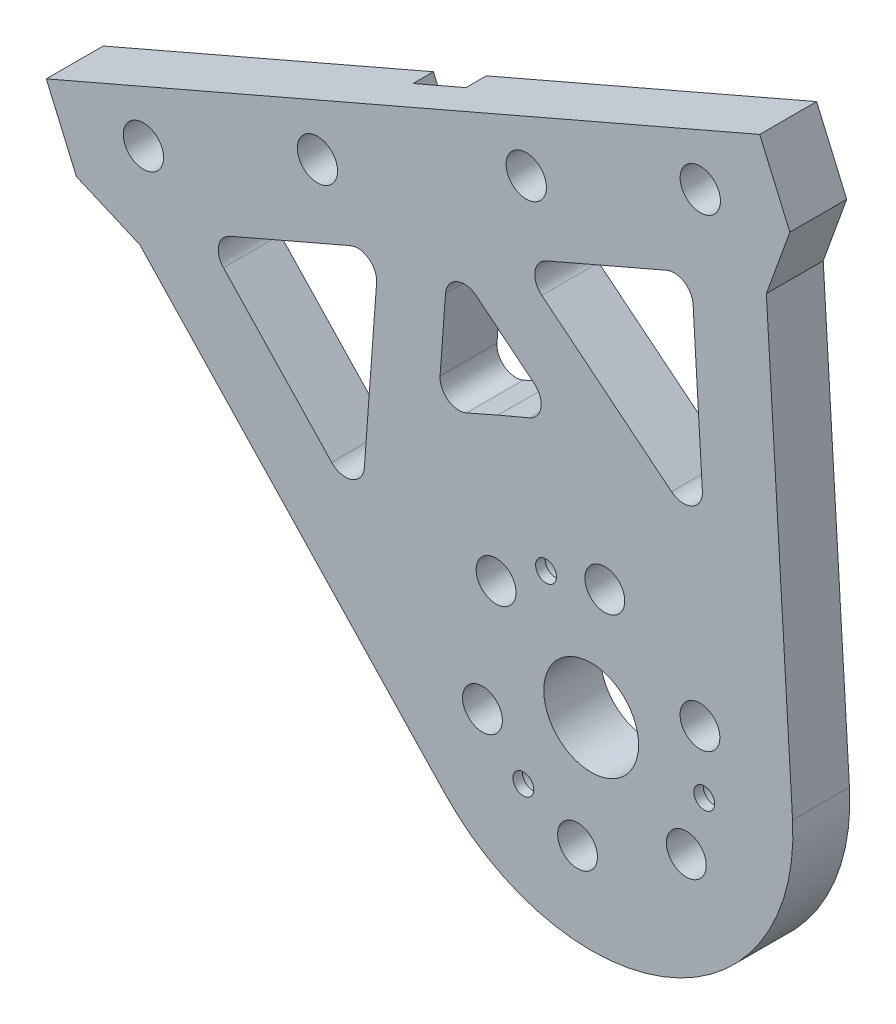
ISO-10303-21;
HEADER;
FILE_DESCRIPTION(('STEP AP214'),'2;1');
FILE_NAME('part.step','',(''),(''),'','','');
FILE_SCHEMA(('AUTOMOTIVE_DESIGN { 1 0 10303 214 1 1 1 1 }'));
ENDSEC;
DATA;
#1=APPLICATION_CONTEXT('core data for automotive mechanical design processes');
#2=APPLICATION_PROTOCOL_DEFINITION('international standard','automotive_design',2000,#1);
#3=PRODUCT_CONTEXT('',#1,'mechanical');
#4=PRODUCT('Part','Part','',(#3));
#5=PRODUCT_RELATED_PRODUCT_CATEGORY('part','',(#4));
#6=PRODUCT_DEFINITION_FORMATION('','',#4);
#7=PRODUCT_DEFINITION_CONTEXT('part definition',#1,'design');
#8=PRODUCT_DEFINITION('design','',#6,#7);
#9=PRODUCT_DEFINITION_SHAPE('','',#8);
#10=(LENGTH_UNIT() NAMED_UNIT(*) SI_UNIT(.MILLI.,.METRE.));
#11=(NAMED_UNIT(*) PLANE_ANGLE_UNIT() SI_UNIT($,.RADIAN.));
#12=(NAMED_UNIT(*) SI_UNIT($,.STERADIAN.) SOLID_ANGLE_UNIT());
#13=UNCERTAINTY_MEASURE_WITH_UNIT(LENGTH_MEASURE(1.E-05),#10,'distance_accuracy_value','');
#14=(GEOMETRIC_REPRESENTATION_CONTEXT(3) GLOBAL_UNCERTAINTY_ASSIGNED_CONTEXT((#13)) GLOBAL_UNIT_ASSIGNED_CONTEXT((#10,
#11,#12)) REPRESENTATION_CONTEXT('',''));
#15=CARTESIAN_POINT('',(0.,0.,0.));
#16=DIRECTION('',(0.,0.,1.));
#17=DIRECTION('',(1.,0.,0.));
#18=AXIS2_PLACEMENT_3D('',#15,#16,#17);
#19=CARTESIAN_POINT('',(66.6737771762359,43.1493753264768,5.15));
#20=DIRECTION('',(0.,0.,-1.));
#21=DIRECTION('',(-1.,0.,0.));
#22=AXIS2_PLACEMENT_3D('',#19,#20,#21);
#23=CYLINDRICAL_SURFACE('',#22,1.1);
#24=CARTESIAN_POINT('',(66.6737771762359,43.1493753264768,5.15));
#25=DIRECTION('',(0.,0.,-1.));
#26=DIRECTION('',(-1.,0.,0.));
#27=AXIS2_PLACEMENT_3D('',#24,#25,#26);
#28=CIRCLE('',#27,1.1);
#29=CARTESIAN_POINT('',(67.6833799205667,43.5860700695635,5.15));
#30=VERTEX_POINT('',#29);
#31=CARTESIAN_POINT('',(65.664174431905,42.7126805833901,5.15));
#32=VERTEX_POINT('',#31);
#33=EDGE_CURVE('E21',#30,#32,#28,.T.);
#34=ORIENTED_EDGE('',*,*,#33,.F.);
#35=DIRECTION('',(0.,0.,-1.));
#36=VECTOR('',#35,1.);
#37=CARTESIAN_POINT('',(67.6833799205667,43.5860700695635,5.15));
#38=LINE('',#37,#36);
#39=CARTESIAN_POINT('',(67.6833799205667,43.5860700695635,3.));
#40=VERTEX_POINT('',#39);
#41=EDGE_CURVE('E263',#30,#40,#38,.T.);
#42=ORIENTED_EDGE('',*,*,#41,.T.);
#43=CARTESIAN_POINT('',(66.6737771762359,43.1493753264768,3.));
#44=DIRECTION('',(0.,0.,-1.));
#45=DIRECTION('',(-1.,0.,0.));
#46=AXIS2_PLACEMENT_3D('',#43,#44,#45);
#47=CIRCLE('',#46,1.1);
#48=CARTESIAN_POINT('',(65.664174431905,42.7126805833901,3.));
#49=VERTEX_POINT('',#48);
#50=EDGE_CURVE('E240',#40,#49,#47,.T.);
#51=ORIENTED_EDGE('',*,*,#50,.T.);
#52=DIRECTION('',(0.,0.,-1.));
#53=VECTOR('',#52,1.);
#54=CARTESIAN_POINT('',(65.664174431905,42.7126805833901,5.15));
#55=LINE('',#54,#53);
#56=EDGE_CURVE('E238',#32,#49,#55,.T.);
#57=ORIENTED_EDGE('',*,*,#56,.F.);
#58=EDGE_LOOP('',(#34,#42,#51,#57));
#59=FACE_BOUND('',#58,.T.);
#60=ADVANCED_FACE('F17',(#59),#23,.F.);
#61=CARTESIAN_POINT('',(63.1126329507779,41.6090338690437,5.15));
#62=DIRECTION('',(0.,0.,-1.));
#63=DIRECTION('',(-1.,0.,0.));
#64=AXIS2_PLACEMENT_3D('',#61,#62,#63);
#65=CYLINDRICAL_SURFACE('',#64,1.1);
#66=CARTESIAN_POINT('',(63.1126329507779,41.6090338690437,3.));
#67=DIRECTION('',(0.,0.,-1.));
#68=DIRECTION('',(-1.,0.,0.));
#69=AXIS2_PLACEMENT_3D('',#66,#67,#68);
#70=CIRCLE('',#69,1.1);
#71=CARTESIAN_POINT('',(64.1222356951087,42.0457286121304,3.));
#72=VERTEX_POINT('',#71);
#73=CARTESIAN_POINT('',(62.103030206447,41.1723391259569,3.));
#74=VERTEX_POINT('',#73);
#75=EDGE_CURVE('E284',#72,#74,#70,.T.);
#76=ORIENTED_EDGE('',*,*,#75,.T.);
#77=DIRECTION('',(0.,0.,-1.));
#78=VECTOR('',#77,1.);
#79=CARTESIAN_POINT('',(62.103030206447,41.1723391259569,5.15));
#80=LINE('',#79,#78);
#81=CARTESIAN_POINT('',(62.103030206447,41.1723391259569,5.15));
#82=VERTEX_POINT('',#81);
#83=EDGE_CURVE('E235',#82,#74,#80,.T.);
#84=ORIENTED_EDGE('',*,*,#83,.F.);
#85=CARTESIAN_POINT('',(63.1126329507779,41.6090338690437,5.15));
#86=DIRECTION('',(0.,0.,-1.));
#87=DIRECTION('',(-1.,0.,0.));
#88=AXIS2_PLACEMENT_3D('',#85,#86,#87);
#89=CIRCLE('',#88,1.1);
#90=CARTESIAN_POINT('',(64.1222356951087,42.0457286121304,5.15));
#91=VERTEX_POINT('',#90);
#92=EDGE_CURVE('E11',#91,#82,#89,.T.);
#93=ORIENTED_EDGE('',*,*,#92,.F.);
#94=DIRECTION('',(0.,0.,1.));
#95=VECTOR('',#94,1.);
#96=CARTESIAN_POINT('',(64.1222356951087,42.0457286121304,5.15));
#97=LINE('',#96,#95);
#98=EDGE_CURVE('E245',#72,#91,#97,.T.);
#99=ORIENTED_EDGE('',*,*,#98,.F.);
#100=EDGE_LOOP('',(#76,#84,#93,#99));
#101=FACE_BOUND('',#100,.T.);
#102=ADVANCED_FACE('F19',(#101),#65,.F.);
#103=CARTESIAN_POINT('',(0.,0.,5.15));
#104=DIRECTION('',(0.,0.,-1.));
#105=DIRECTION('',(0.,-1.,0.));
#106=AXIS2_PLACEMENT_3D('',#103,#104,#105);
#107=PLANE('',#106);
#108=DIRECTION('',(0.396995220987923,-0.917820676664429,0.));
#109=VECTOR('',#108,1.);
#110=CARTESIAN_POINT('',(72.8976016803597,31.5312132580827,5.15));
#111=LINE('',#110,#109);
#112=CARTESIAN_POINT('',(66.095399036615,47.2573527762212,5.15));
#113=VERTEX_POINT('',#112);
#114=EDGE_CURVE('E232',#113,#30,#111,.T.);
#115=ORIENTED_EDGE('',*,*,#114,.T.);
#116=ORIENTED_EDGE('',*,*,#33,.T.);
#117=DIRECTION('',(-0.91782067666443,-0.396995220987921,0.));
#118=VECTOR('',#117,1.);
#119=CARTESIAN_POINT('',(-5.21422175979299,12.0548568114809,5.15));
#120=LINE('',#119,#118);
#121=EDGE_CURVE('E230',#32,#91,#120,.T.);
#122=ORIENTED_EDGE('',*,*,#121,.T.);
#123=ORIENTED_EDGE('',*,*,#92,.T.);
#124=DIRECTION('',(-0.396995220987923,0.917820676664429,0.));
#125=VECTOR('',#124,1.);
#126=CARTESIAN_POINT('',(67.31725196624,29.1174823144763,5.15));
#127=LINE('',#126,#125);
#128=CARTESIAN_POINT('',(60.5150493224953,44.8436218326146,5.15));
#129=VERTEX_POINT('',#128);
#130=EDGE_CURVE('E268',#82,#129,#127,.T.);
#131=ORIENTED_EDGE('',*,*,#130,.T.);
#132=DIRECTION('',(0.91782067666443,0.396995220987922,0.));
#133=VECTOR('',#132,1.);
#134=CARTESIAN_POINT('',(-6.80220264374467,15.7261395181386,5.15));
#135=LINE('',#134,#133);
#136=EDGE_CURVE('E621',#129,#113,#135,.T.);
#137=ORIENTED_EDGE('',*,*,#136,.T.);
#138=EDGE_LOOP('',(#115,#116,#122,#123,#131,#137));
#139=FACE_BOUND('',#138,.T.);
#140=ADVANCED_FACE('F228',(#139),#107,.T.);
#141=CARTESIAN_POINT('',(67.31725196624,29.1174823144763,5.15));
#142=DIRECTION('',(-0.917820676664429,-0.396995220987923,0.));
#143=DIRECTION('',(-0.396995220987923,0.917820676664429,0.));
#144=AXIS2_PLACEMENT_3D('',#141,#142,#143);
#145=PLANE('',#144);
#146=DIRECTION('',(-0.396995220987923,0.917820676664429,0.));
#147=VECTOR('',#146,1.);
#148=CARTESIAN_POINT('',(67.31725196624,29.1174823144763,3.));
#149=LINE('',#148,#147);
#150=CARTESIAN_POINT('',(60.5150493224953,44.8436218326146,3.));
#151=VERTEX_POINT('',#150);
#152=EDGE_CURVE('E280',#74,#151,#149,.T.);
#153=ORIENTED_EDGE('',*,*,#152,.T.);
#154=DIRECTION('',(0.,0.,-1.));
#155=VECTOR('',#154,1.);
#156=CARTESIAN_POINT('',(60.5150493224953,44.8436218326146,5.15));
#157=LINE('',#156,#155);
#158=EDGE_CURVE('E624',#129,#151,#157,.T.);
#159=ORIENTED_EDGE('',*,*,#158,.F.);
#160=ORIENTED_EDGE('',*,*,#130,.F.);
#161=ORIENTED_EDGE('',*,*,#83,.T.);
#162=EDGE_LOOP('',(#153,#159,#160,#161));
#163=FACE_BOUND('',#162,.T.);
#164=ADVANCED_FACE('F277',(#163),#145,.F.);
#165=CARTESIAN_POINT('',(72.8976016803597,31.5312132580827,5.15));
#166=DIRECTION('',(0.917820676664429,0.396995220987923,0.));
#167=DIRECTION('',(0.,0.,-1.));
#168=AXIS2_PLACEMENT_3D('',#165,#166,#167);
#169=PLANE('',#168);
#170=DIRECTION('',(0.396995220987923,-0.917820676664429,0.));
#171=VECTOR('',#170,1.);
#172=CARTESIAN_POINT('',(72.8976016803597,31.5312132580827,3.));
#173=LINE('',#172,#171);
#174=CARTESIAN_POINT('',(66.095399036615,47.2573527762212,3.));
#175=VERTEX_POINT('',#174);
#176=EDGE_CURVE('E657',#175,#40,#173,.T.);
#177=ORIENTED_EDGE('',*,*,#176,.T.);
#178=ORIENTED_EDGE('',*,*,#41,.F.);
#179=ORIENTED_EDGE('',*,*,#114,.F.);
#180=DIRECTION('',(0.,0.,-1.));
#181=VECTOR('',#180,1.);
#182=CARTESIAN_POINT('',(66.095399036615,47.2573527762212,5.15));
#183=LINE('',#182,#181);
#184=EDGE_CURVE('E617',#113,#175,#183,.T.);
#185=ORIENTED_EDGE('',*,*,#184,.T.);
#186=EDGE_LOOP('',(#177,#178,#179,#185));
#187=FACE_BOUND('',#186,.T.);
#188=ADVANCED_FACE('F930',(#187),#169,.F.);
#189=CARTESIAN_POINT('',(-5.21422175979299,12.0548568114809,5.15));
#190=DIRECTION('',(0.396995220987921,-0.91782067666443,0.));
#191=DIRECTION('',(0.,0.,-1.));
#192=AXIS2_PLACEMENT_3D('',#189,#190,#191);
#193=PLANE('',#192);
#194=ORIENTED_EDGE('',*,*,#121,.F.);
#195=ORIENTED_EDGE('',*,*,#56,.T.);
#196=DIRECTION('',(-0.91782067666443,-0.396995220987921,0.));
#197=VECTOR('',#196,1.);
#198=CARTESIAN_POINT('',(-5.21422175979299,12.0548568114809,3.));
#199=LINE('',#198,#197);
#200=EDGE_CURVE('E652',#49,#72,#199,.T.);
#201=ORIENTED_EDGE('',*,*,#200,.T.);
#202=ORIENTED_EDGE('',*,*,#98,.T.);
#203=EDGE_LOOP('',(#194,#195,#201,#202));
#204=FACE_BOUND('',#203,.T.);
#205=ADVANCED_FACE('F248',(#204),#193,.F.);
#206=CARTESIAN_POINT('',(75.9986842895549,-9.4731659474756,8.));
#207=DIRECTION('',(0.,0.,1.));
#208=DIRECTION('',(1.,0.,0.));
#209=AXIS2_PLACEMENT_3D('',#206,#207,#208);
#210=PLANE('',#209);
#211=CARTESIAN_POINT('',(75.9986842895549,-9.4731659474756,8.));
#212=DIRECTION('',(0.,0.,1.));
#213=DIRECTION('',(1.,0.,0.));
#214=AXIS2_PLACEMENT_3D('',#211,#212,#213);
#215=CIRCLE('',#214,1.1);
#216=CARTESIAN_POINT('',(77.0986842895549,-9.4731659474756,8.));
#217=VERTEX_POINT('',#216);
#218=EDGE_CURVE('E417',#217,#217,#215,.T.);
#219=ORIENTED_EDGE('',*,*,#218,.T.);
#220=EDGE_LOOP('',(#219));
#221=FACE_BOUND('',#220,.T.);
#222=CARTESIAN_POINT('',(75.9986842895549,-9.4731659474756,8.));
#223=DIRECTION('',(0.,0.,1.));
#224=DIRECTION('',(1.,0.,0.));
#225=AXIS2_PLACEMENT_3D('',#222,#223,#224);
#226=CIRCLE('',#225,1.9999999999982);
#227=CARTESIAN_POINT('',(77.9986842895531,-9.4731659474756,8.));
#228=VERTEX_POINT('',#227);
#229=EDGE_CURVE('E327',#228,#228,#226,.T.);
#230=ORIENTED_EDGE('',*,*,#229,.F.);
#231=EDGE_LOOP('',(#230));
#232=FACE_BOUND('',#231,.T.);
#233=ADVANCED_FACE('F938',(#221,#232),#210,.F.);
#234=CARTESIAN_POINT('',(95.0752288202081,-1.2217752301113,8.));
#235=DIRECTION('',(0.,0.,1.));
#236=DIRECTION('',(1.,0.,0.));
#237=AXIS2_PLACEMENT_3D('',#234,#235,#236);
#238=PLANE('',#237);
#239=CARTESIAN_POINT('',(95.0752288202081,-1.2217752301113,8.));
#240=DIRECTION('',(0.,0.,1.));
#241=DIRECTION('',(1.,0.,0.));
#242=AXIS2_PLACEMENT_3D('',#239,#240,#241);
#243=CIRCLE('',#242,1.1);
#244=CARTESIAN_POINT('',(96.1752288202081,-1.2217752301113,8.));
#245=VERTEX_POINT('',#244);
#246=EDGE_CURVE('E444',#245,#245,#243,.T.);
#247=ORIENTED_EDGE('',*,*,#246,.T.);
#248=EDGE_LOOP('',(#247));
#249=FACE_BOUND('',#248,.T.);
#250=CARTESIAN_POINT('',(95.0752288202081,-1.2217752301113,8.));
#251=DIRECTION('',(0.,0.,1.));
#252=DIRECTION('',(1.,0.,0.));
#253=AXIS2_PLACEMENT_3D('',#250,#251,#252);
#254=CIRCLE('',#253,1.99999999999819);
#255=CARTESIAN_POINT('',(97.0752288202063,-1.2217752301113,8.));
#256=VERTEX_POINT('',#255);
#257=EDGE_CURVE('E448',#256,#256,#254,.T.);
#258=ORIENTED_EDGE('',*,*,#257,.F.);
#259=EDGE_LOOP('',(#258));
#260=FACE_BOUND('',#259,.T.);
#261=ADVANCED_FACE('F994',(#249,#260),#238,.F.);
#262=CARTESIAN_POINT('',(78.3910425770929,11.1733015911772,8.));
#263=DIRECTION('',(0.,0.,1.));
#264=DIRECTION('',(1.,0.,0.));
#265=AXIS2_PLACEMENT_3D('',#262,#263,#264);
#266=PLANE('',#265);
#267=CARTESIAN_POINT('',(78.3910425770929,11.1733015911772,8.));
#268=DIRECTION('',(0.,0.,1.));
#269=DIRECTION('',(1.,0.,0.));
#270=AXIS2_PLACEMENT_3D('',#267,#268,#269);
#271=CIRCLE('',#270,1.1);
#272=CARTESIAN_POINT('',(79.4910425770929,11.1733015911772,8.));
#273=VERTEX_POINT('',#272);
#274=EDGE_CURVE('E461',#273,#273,#271,.T.);
#275=ORIENTED_EDGE('',*,*,#274,.T.);
#276=EDGE_LOOP('',(#275));
#277=FACE_BOUND('',#276,.T.);
#278=CARTESIAN_POINT('',(78.3910425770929,11.1733015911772,8.));
#279=DIRECTION('',(0.,0.,1.));
#280=DIRECTION('',(1.,0.,0.));
#281=AXIS2_PLACEMENT_3D('',#278,#279,#280);
#282=CIRCLE('',#281,1.99999999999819);
#283=CARTESIAN_POINT('',(80.3910425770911,11.1733015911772,8.));
#284=VERTEX_POINT('',#283);
#285=EDGE_CURVE('E328',#284,#284,#282,.T.);
#286=ORIENTED_EDGE('',*,*,#285,.F.);
#287=EDGE_LOOP('',(#286));
#288=FACE_BOUND('',#287,.T.);
#289=ADVANCED_FACE('F997',(#277,#288),#266,.F.);
#290=CARTESIAN_POINT('',(107.738074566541,46.6011518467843,-13.1849633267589));
#291=DIRECTION('',(-0.917820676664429,-0.396995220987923,0.));
#292=DIRECTION('',(-0.396995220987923,0.917820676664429,0.));
#293=AXIS2_PLACEMENT_3D('',#290,#291,#292);
#294=PLANE('',#293);
#295=DIRECTION('',(0.,0.,1.));
#296=VECTOR('',#295,1.);
#297=CARTESIAN_POINT('',(104.1118336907,54.9847259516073,-13.1849633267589));
#298=LINE('',#297,#296);
#299=CARTESIAN_POINT('',(104.1118336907,54.9847259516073,3.));
#300=VERTEX_POINT('',#299);
#301=CARTESIAN_POINT('',(104.1118336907,54.9847259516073,9.));
#302=VERTEX_POINT('',#301);
#303=EDGE_CURVE('E250',#300,#302,#298,.T.);
#304=ORIENTED_EDGE('',*,*,#303,.F.);
#305=DIRECTION('',(-0.396995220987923,0.917820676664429,0.));
#306=VECTOR('',#305,1.);
#307=CARTESIAN_POINT('',(107.738074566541,46.6011518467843,3.));
#308=LINE('',#307,#306);
#309=CARTESIAN_POINT('',(100.935871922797,62.3272913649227,3.));
#310=VERTEX_POINT('',#309);
#311=EDGE_CURVE('E661',#300,#310,#308,.T.);
#312=ORIENTED_EDGE('',*,*,#311,.T.);
#313=DIRECTION('',(0.,0.,1.));
#314=VECTOR('',#313,1.);
#315=CARTESIAN_POINT('',(100.935871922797,62.3272913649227,-13.1849633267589));
#316=LINE('',#315,#314);
#317=CARTESIAN_POINT('',(100.935871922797,62.3272913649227,9.));
#318=VERTEX_POINT('',#317);
#319=EDGE_CURVE('E633',#310,#318,#316,.T.);
#320=ORIENTED_EDGE('',*,*,#319,.T.);
#321=DIRECTION('',(0.396995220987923,-0.917820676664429,0.));
#322=VECTOR('',#321,1.);
#323=CARTESIAN_POINT('',(107.738074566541,46.6011518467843,9.));
#324=LINE('',#323,#322);
#325=EDGE_CURVE('E384',#318,#302,#324,.T.);
#326=ORIENTED_EDGE('',*,*,#325,.T.);
#327=EDGE_LOOP('',(#304,#312,#320,#326));
#328=FACE_BOUND('',#327,.T.);
#329=ADVANCED_FACE('F898',(#328),#294,.F.);
#330=CARTESIAN_POINT('',(74.4692096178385,-26.9437721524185,-13.1849633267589));
#331=DIRECTION('',(-0.940343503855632,0.340226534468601,0.));
#332=DIRECTION('',(0.,0.,1.));
#333=AXIS2_PLACEMENT_3D('',#330,#331,#332);
#334=PLANE('',#333);
#335=DIRECTION('',(0.,0.,1.));
#336=VECTOR('',#335,1.);
#337=CARTESIAN_POINT('',(101.630525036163,48.1266997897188,-31.25));
#338=LINE('',#337,#336);
#339=CARTESIAN_POINT('',(101.630525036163,48.1266997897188,3.));
#340=VERTEX_POINT('',#339);
#341=CARTESIAN_POINT('',(101.630525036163,48.1266997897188,9.));
#342=VERTEX_POINT('',#341);
#343=EDGE_CURVE('E641',#340,#342,#338,.T.);
#344=ORIENTED_EDGE('',*,*,#343,.F.);
#345=DIRECTION('',(0.340226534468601,0.940343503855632,0.));
#346=VECTOR('',#345,1.);
#347=CARTESIAN_POINT('',(74.4692096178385,-26.9437721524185,3.));
#348=LINE('',#347,#346);
#349=EDGE_CURVE('E607',#340,#300,#348,.T.);
#350=ORIENTED_EDGE('',*,*,#349,.T.);
#351=ORIENTED_EDGE('',*,*,#303,.T.);
#352=DIRECTION('',(-0.340226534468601,-0.940343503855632,0.));
#353=VECTOR('',#352,1.);
#354=CARTESIAN_POINT('',(74.4692096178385,-26.9437721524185,9.));
#355=LINE('',#354,#353);
#356=EDGE_CURVE('E380',#302,#342,#355,.T.);
#357=ORIENTED_EDGE('',*,*,#356,.T.);
#358=EDGE_LOOP('',(#344,#350,#351,#357));
#359=FACE_BOUND('',#358,.T.);
#360=ADVANCED_FACE('F926',(#359),#334,.F.);
#361=CARTESIAN_POINT('',(12.68080921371,29.4044019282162,-13.1849633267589));
#362=DIRECTION('',(-0.396000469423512,-0.918250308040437,0.));
#363=DIRECTION('',(-0.918250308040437,0.396000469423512,0.));
#364=AXIS2_PLACEMENT_3D('',#361,#362,#363);
#365=PLANE('',#364);
#366=DIRECTION('',(-0.918250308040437,0.396000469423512,0.));
#367=VECTOR('',#366,1.);
#368=CARTESIAN_POINT('',(12.68080921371,29.4044019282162,3.));
#369=LINE('',#368,#367);
#370=CARTESIAN_POINT('',(35.5474363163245,19.5430438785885,3.));
#371=VERTEX_POINT('',#370);
#372=CARTESIAN_POINT('',(28.8505382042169,22.4311178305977,3.));
#373=VERTEX_POINT('',#372);
#374=EDGE_CURVE('E300',#371,#373,#369,.T.);
#375=ORIENTED_EDGE('',*,*,#374,.F.);
#376=DIRECTION('',(0.,0.,1.));
#377=VECTOR('',#376,1.);
#378=CARTESIAN_POINT('',(35.5474363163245,19.5430438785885,-31.25));
#379=LINE('',#378,#377);
#380=CARTESIAN_POINT('',(35.5474363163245,19.5430438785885,9.));
#381=VERTEX_POINT('',#380);
#382=EDGE_CURVE('E645',#371,#381,#379,.T.);
#383=ORIENTED_EDGE('',*,*,#382,.T.);
#384=DIRECTION('',(0.918250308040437,-0.396000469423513,0.));
#385=VECTOR('',#384,1.);
#386=CARTESIAN_POINT('',(12.68080921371,29.4044019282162,9.));
#387=LINE('',#386,#385);
#388=CARTESIAN_POINT('',(28.8505382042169,22.4311178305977,9.));
#389=VERTEX_POINT('',#388);
#390=EDGE_CURVE('E580',#389,#381,#387,.T.);
#391=ORIENTED_EDGE('',*,*,#390,.F.);
#392=DIRECTION('',(0.,0.,1.));
#393=VECTOR('',#392,1.);
#394=CARTESIAN_POINT('',(28.8505382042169,22.4311178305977,-13.1849633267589));
#395=LINE('',#394,#393);
#396=EDGE_CURVE('E257',#373,#389,#395,.T.);
#397=ORIENTED_EDGE('',*,*,#396,.F.);
#398=EDGE_LOOP('',(#375,#383,#391,#397));
#399=FACE_BOUND('',#398,.T.);
#400=ADVANCED_FACE('F911',(#399),#365,.T.);
#401=CARTESIAN_POINT('',(32.4767790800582,14.0475437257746,-13.1849633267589));
#402=DIRECTION('',(-0.91782067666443,-0.396995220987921,0.));
#403=DIRECTION('',(-0.396995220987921,0.91782067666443,0.));
#404=AXIS2_PLACEMENT_3D('',#401,#402,#403);
#405=PLANE('',#404);
#406=DIRECTION('',(-0.396995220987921,0.91782067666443,0.));
#407=VECTOR('',#406,1.);
#408=CARTESIAN_POINT('',(32.4767790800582,14.0475437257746,3.));
#409=LINE('',#408,#407);
#410=CARTESIAN_POINT('',(25.6745764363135,29.7736832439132,3.));
#411=VERTEX_POINT('',#410);
#412=EDGE_CURVE('E295',#373,#411,#409,.T.);
#413=ORIENTED_EDGE('',*,*,#412,.F.);
#414=ORIENTED_EDGE('',*,*,#396,.T.);
#415=DIRECTION('',(0.396995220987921,-0.91782067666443,0.));
#416=VECTOR('',#415,1.);
#417=CARTESIAN_POINT('',(32.4767790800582,14.0475437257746,9.));
#418=LINE('',#417,#416);
#419=CARTESIAN_POINT('',(25.6745764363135,29.7736832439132,9.));
#420=VERTEX_POINT('',#419);
#421=EDGE_CURVE('E457',#420,#389,#418,.T.);
#422=ORIENTED_EDGE('',*,*,#421,.F.);
#423=DIRECTION('',(0.,0.,1.));
#424=VECTOR('',#423,1.);
#425=CARTESIAN_POINT('',(25.6745764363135,29.7736832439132,-13.1849633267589));
#426=LINE('',#425,#424);
#427=EDGE_CURVE('E629',#411,#420,#426,.T.);
#428=ORIENTED_EDGE('',*,*,#427,.F.);
#429=EDGE_LOOP('',(#413,#414,#422,#428));
#430=FACE_BOUND('',#429,.T.);
#431=ADVANCED_FACE('F907',(#430),#405,.T.);
#432=CARTESIAN_POINT('',(57.2296528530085,11.1638491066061,-21.));
#433=DIRECTION('',(0.,0.,-1.));
#434=DIRECTION('',(-1.,0.,0.));
#435=AXIS2_PLACEMENT_3D('',#432,#433,#434);
#436=CYLINDRICAL_SURFACE('',#435,2.);
#437=CARTESIAN_POINT('',(57.2296528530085,11.1638491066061,3.));
#438=DIRECTION('',(0.,0.,1.));
#439=DIRECTION('',(1.,0.,0.));
#440=AXIS2_PLACEMENT_3D('',#437,#438,#439);
#441=CIRCLE('',#440,2.);
#442=CARTESIAN_POINT('',(55.7762749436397,9.78991582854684,3.));
#443=VERTEX_POINT('',#442);
#444=CARTESIAN_POINT('',(59.2242508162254,11.016951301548,3.));
#445=VERTEX_POINT('',#444);
#446=EDGE_CURVE('E600',#443,#445,#441,.T.);
#447=ORIENTED_EDGE('',*,*,#446,.F.);
#448=DIRECTION('',(0.,0.,-1.));
#449=VECTOR('',#448,1.);
#450=CARTESIAN_POINT('',(55.7762749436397,9.78991582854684,3.));
#451=LINE('',#450,#449);
#452=CARTESIAN_POINT('',(55.7762749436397,9.78991582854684,9.));
#453=VERTEX_POINT('',#452);
#454=EDGE_CURVE('E498',#453,#443,#451,.T.);
#455=ORIENTED_EDGE('',*,*,#454,.F.);
#456=CARTESIAN_POINT('',(57.2296528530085,11.1638491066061,9.));
#457=DIRECTION('',(0.,0.,-1.));
#458=DIRECTION('',(1.,0.,0.));
#459=AXIS2_PLACEMENT_3D('',#456,#457,#458);
#460=CIRCLE('',#459,2.);
#461=CARTESIAN_POINT('',(59.2242508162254,11.016951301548,9.));
#462=VERTEX_POINT('',#461);
#463=EDGE_CURVE('E591',#462,#453,#460,.T.);
#464=ORIENTED_EDGE('',*,*,#463,.F.);
#465=DIRECTION('',(0.,0.,1.));
#466=VECTOR('',#465,1.);
#467=CARTESIAN_POINT('',(59.2242508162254,11.016951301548,9.));
#468=LINE('',#467,#466);
#469=EDGE_CURVE('E430',#445,#462,#468,.T.);
#470=ORIENTED_EDGE('',*,*,#469,.F.);
#471=EDGE_LOOP('',(#447,#455,#464,#470));
#472=FACE_BOUND('',#471,.T.);
#473=ADVANCED_FACE('F765',(#472),#436,.F.);
#474=CARTESIAN_POINT('',(58.5232559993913,28.7285649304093,-21.));
#475=DIRECTION('',(0.,0.,-1.));
#476=DIRECTION('',(-1.,0.,0.));
#477=AXIS2_PLACEMENT_3D('',#474,#475,#476);
#478=CYLINDRICAL_SURFACE('',#477,2.);
#479=CARTESIAN_POINT('',(58.5232559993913,28.7285649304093,3.));
#480=DIRECTION('',(0.,0.,1.));
#481=DIRECTION('',(1.,0.,0.));
#482=AXIS2_PLACEMENT_3D('',#479,#480,#481);
#483=CIRCLE('',#482,2.);
#484=CARTESIAN_POINT('',(60.5178539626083,28.5816671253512,3.));
#485=VERTEX_POINT('',#484);
#486=CARTESIAN_POINT('',(57.7292655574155,30.5642062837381,3.));
#487=VERTEX_POINT('',#486);
#488=EDGE_CURVE('E670',#485,#487,#483,.T.);
#489=ORIENTED_EDGE('',*,*,#488,.F.);
#490=DIRECTION('',(0.,0.,-1.));
#491=VECTOR('',#490,1.);
#492=CARTESIAN_POINT('',(60.5178539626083,28.5816671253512,3.));
#493=LINE('',#492,#491);
#494=CARTESIAN_POINT('',(60.5178539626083,28.5816671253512,9.));
#495=VERTEX_POINT('',#494);
#496=EDGE_CURVE('E497',#495,#485,#493,.T.);
#497=ORIENTED_EDGE('',*,*,#496,.F.);
#498=CARTESIAN_POINT('',(58.5232559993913,28.7285649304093,9.));
#499=DIRECTION('',(0.,0.,-1.));
#500=DIRECTION('',(1.,0.,0.));
#501=AXIS2_PLACEMENT_3D('',#498,#499,#500);
#502=CIRCLE('',#501,2.);
#503=CARTESIAN_POINT('',(57.7292655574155,30.5642062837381,9.));
#504=VERTEX_POINT('',#503);
#505=EDGE_CURVE('E390',#504,#495,#502,.T.);
#506=ORIENTED_EDGE('',*,*,#505,.F.);
#507=DIRECTION('',(0.,0.,1.));
#508=VECTOR('',#507,1.);
#509=CARTESIAN_POINT('',(57.7292655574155,30.5642062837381,9.));
#510=LINE('',#509,#508);
#511=EDGE_CURVE('E493',#487,#504,#510,.T.);
#512=ORIENTED_EDGE('',*,*,#511,.F.);
#513=EDGE_LOOP('',(#489,#497,#506,#512));
#514=FACE_BOUND('',#513,.T.);
#515=ADVANCED_FACE('F967',(#514),#478,.F.);
#516=CARTESIAN_POINT('',(69.7828059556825,31.0748448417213,-21.));
#517=DIRECTION('',(0.,0.,-1.));
#518=DIRECTION('',(-1.,0.,0.));
#519=AXIS2_PLACEMENT_3D('',#516,#517,#518);
#520=CYLINDRICAL_SURFACE('',#519,2.);
#521=CARTESIAN_POINT('',(69.7828059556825,31.0748448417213,3.));
#522=DIRECTION('',(0.,0.,1.));
#523=DIRECTION('',(1.,0.,0.));
#524=AXIS2_PLACEMENT_3D('',#521,#522,#523);
#525=CIRCLE('',#524,2.);
#526=CARTESIAN_POINT('',(71.0416354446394,32.628983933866,3.));
#527=VERTEX_POINT('',#526);
#528=CARTESIAN_POINT('',(67.7882079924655,31.2217426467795,3.));
#529=VERTEX_POINT('',#528);
#530=EDGE_CURVE('E542',#527,#529,#525,.T.);
#531=ORIENTED_EDGE('',*,*,#530,.F.);
#532=DIRECTION('',(0.,0.,-1.));
#533=VECTOR('',#532,1.);
#534=CARTESIAN_POINT('',(71.0416354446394,32.628983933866,3.));
#535=LINE('',#534,#533);
#536=CARTESIAN_POINT('',(71.0416354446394,32.628983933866,9.));
#537=VERTEX_POINT('',#536);
#538=EDGE_CURVE('E730',#537,#527,#535,.T.);
#539=ORIENTED_EDGE('',*,*,#538,.F.);
#540=CARTESIAN_POINT('',(69.7828059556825,31.0748448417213,9.));
#541=DIRECTION('',(0.,0.,-1.));
#542=DIRECTION('',(1.,0.,0.));
#543=AXIS2_PLACEMENT_3D('',#540,#541,#542);
#544=CIRCLE('',#543,2.);
#545=CARTESIAN_POINT('',(67.7882079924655,31.2217426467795,9.));
#546=VERTEX_POINT('',#545);
#547=EDGE_CURVE('E343',#546,#537,#544,.T.);
#548=ORIENTED_EDGE('',*,*,#547,.F.);
#549=DIRECTION('',(0.,0.,1.));
#550=VECTOR('',#549,1.);
#551=CARTESIAN_POINT('',(67.7882079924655,31.2217426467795,9.));
#552=LINE('',#551,#550);
#553=EDGE_CURVE('E724',#529,#546,#552,.T.);
#554=ORIENTED_EDGE('',*,*,#553,.F.);
#555=EDGE_LOOP('',(#531,#539,#548,#554));
#556=FACE_BOUND('',#555,.T.);
#557=ADVANCED_FACE('F993',(#556),#520,.F.);
#558=CARTESIAN_POINT('',(74.1211924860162,21.0448478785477,-21.));
#559=DIRECTION('',(0.,0.,1.));
#560=DIRECTION('',(1.,0.,0.));
#561=AXIS2_PLACEMENT_3D('',#558,#559,#560);
#562=CYLINDRICAL_SURFACE('',#561,2.);
#563=CARTESIAN_POINT('',(74.1211924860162,21.0448478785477,3.));
#564=DIRECTION('',(0.,0.,-1.));
#565=DIRECTION('',(1.,8.25728374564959E-13,0.));
#566=AXIS2_PLACEMENT_3D('',#563,#564,#565);
#567=CIRCLE('',#566,2.);
#568=CARTESIAN_POINT('',(73.3144885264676,22.8749376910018,3.));
#569=VERTEX_POINT('',#568);
#570=CARTESIAN_POINT('',(73.3399537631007,22.8859524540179,3.));
#571=VERTEX_POINT('',#570);
#572=EDGE_CURVE('E599',#569,#571,#567,.T.);
#573=ORIENTED_EDGE('',*,*,#572,.F.);
#574=DIRECTION('',(0.,0.,-1.));
#575=VECTOR('',#574,1.);
#576=CARTESIAN_POINT('',(73.3144885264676,22.8749376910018,-21.));
#577=LINE('',#576,#575);
#578=CARTESIAN_POINT('',(73.3144885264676,22.8749376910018,9.));
#579=VERTEX_POINT('',#578);
#580=EDGE_CURVE('E739',#579,#569,#577,.T.);
#581=ORIENTED_EDGE('',*,*,#580,.F.);
#582=CARTESIAN_POINT('',(74.1211924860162,21.0448478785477,9.));
#583=DIRECTION('',(0.,0.,1.));
#584=DIRECTION('',(1.,0.,0.));
#585=AXIS2_PLACEMENT_3D('',#582,#583,#584);
#586=CIRCLE('',#585,2.);
#587=CARTESIAN_POINT('',(73.3399537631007,22.8859524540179,9.));
#588=VERTEX_POINT('',#587);
#589=EDGE_CURVE('E337',#588,#579,#586,.T.);
#590=ORIENTED_EDGE('',*,*,#589,.F.);
#591=DIRECTION('',(0.,0.,1.));
#592=VECTOR('',#591,1.);
#593=CARTESIAN_POINT('',(73.3399537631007,22.8859524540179,-21.));
#594=LINE('',#593,#592);
#595=EDGE_CURVE('E736',#571,#588,#594,.T.);
#596=ORIENTED_EDGE('',*,*,#595,.F.);
#597=EDGE_LOOP('',(#573,#581,#590,#596));
#598=FACE_BOUND('',#597,.T.);
#599=ADVANCED_FACE('F813',(#598),#562,.T.);
#600=CARTESIAN_POINT('',(75.8798587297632,26.1363230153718,-21.));
#601=DIRECTION('',(0.,0.,-1.));
#602=DIRECTION('',(-1.,0.,0.));
#603=AXIS2_PLACEMENT_3D('',#600,#601,#602);
#604=CYLINDRICAL_SURFACE('',#603,2.);
#605=CARTESIAN_POINT('',(75.8798587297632,26.1363230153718,3.));
#606=DIRECTION('',(0.,0.,1.));
#607=DIRECTION('',(1.,0.,0.));
#608=AXIS2_PLACEMENT_3D('',#605,#606,#607);
#609=CIRCLE('',#608,2.);
#610=CARTESIAN_POINT('',(76.6610974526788,24.2952184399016,3.));
#611=VERTEX_POINT('',#610);
#612=CARTESIAN_POINT('',(77.1386882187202,27.6904621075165,3.));
#613=VERTEX_POINT('',#612);
#614=EDGE_CURVE('E692',#611,#613,#609,.T.);
#615=ORIENTED_EDGE('',*,*,#614,.F.);
#616=DIRECTION('',(0.,0.,-1.));
#617=VECTOR('',#616,1.);
#618=CARTESIAN_POINT('',(76.6610974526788,24.2952184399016,3.));
#619=LINE('',#618,#617);
#620=CARTESIAN_POINT('',(76.6610974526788,24.2952184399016,9.));
#621=VERTEX_POINT('',#620);
#622=EDGE_CURVE('E733',#621,#611,#619,.T.);
#623=ORIENTED_EDGE('',*,*,#622,.F.);
#624=CARTESIAN_POINT('',(75.8798587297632,26.1363230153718,9.));
#625=DIRECTION('',(0.,0.,-1.));
#626=DIRECTION('',(1.,0.,0.));
#627=AXIS2_PLACEMENT_3D('',#624,#625,#626);
#628=CIRCLE('',#627,2.);
#629=CARTESIAN_POINT('',(77.1386882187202,27.6904621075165,9.));
#630=VERTEX_POINT('',#629);
#631=EDGE_CURVE('E379',#630,#621,#628,.T.);
#632=ORIENTED_EDGE('',*,*,#631,.F.);
#633=DIRECTION('',(0.,0.,1.));
#634=VECTOR('',#633,1.);
#635=CARTESIAN_POINT('',(77.1386882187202,27.6904621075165,9.));
#636=LINE('',#635,#634);
#637=EDGE_CURVE('E727',#613,#630,#636,.T.);
#638=ORIENTED_EDGE('',*,*,#637,.F.);
#639=EDGE_LOOP('',(#615,#623,#632,#638));
#640=FACE_BOUND('',#639,.T.);
#641=ADVANCED_FACE('F986',(#640),#604,.F.);
#642=CARTESIAN_POINT('',(92.8890303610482,26.5879976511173,-21.));
#643=DIRECTION('',(0.,0.,-1.));
#644=DIRECTION('',(-1.,0.,0.));
#645=AXIS2_PLACEMENT_3D('',#642,#643,#644);
#646=CYLINDRICAL_SURFACE('',#645,2.);
#647=CARTESIAN_POINT('',(92.8890303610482,26.5879976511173,3.));
#648=DIRECTION('',(0.,0.,1.));
#649=DIRECTION('',(1.,0.,0.));
#650=AXIS2_PLACEMENT_3D('',#647,#648,#649);
#651=CIRCLE('',#650,2.);
#652=CARTESIAN_POINT('',(91.6302008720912,25.0338585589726,3.));
#653=VERTEX_POINT('',#652);
#654=CARTESIAN_POINT('',(94.8855297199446,26.7062782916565,3.));
#655=VERTEX_POINT('',#654);
#656=EDGE_CURVE('E362',#653,#655,#651,.T.);
#657=ORIENTED_EDGE('',*,*,#656,.F.);
#658=DIRECTION('',(0.,0.,-1.));
#659=VECTOR('',#658,1.);
#660=CARTESIAN_POINT('',(91.6302008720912,25.0338585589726,3.));
#661=LINE('',#660,#659);
#662=CARTESIAN_POINT('',(91.6302008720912,25.0338585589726,9.));
#663=VERTEX_POINT('',#662);
#664=EDGE_CURVE('E358',#663,#653,#661,.T.);
#665=ORIENTED_EDGE('',*,*,#664,.F.);
#666=CARTESIAN_POINT('',(92.8890303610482,26.5879976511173,9.));
#667=DIRECTION('',(0.,0.,-1.));
#668=DIRECTION('',(1.,0.,0.));
#669=AXIS2_PLACEMENT_3D('',#666,#667,#668);
#670=CIRCLE('',#669,2.);
#671=CARTESIAN_POINT('',(94.8855297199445,26.7062782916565,9.));
#672=VERTEX_POINT('',#671);
#673=EDGE_CURVE('E439',#672,#663,#670,.T.);
#674=ORIENTED_EDGE('',*,*,#673,.F.);
#675=DIRECTION('',(0.,0.,1.));
#676=VECTOR('',#675,1.);
#677=CARTESIAN_POINT('',(94.8855297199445,26.7062782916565,9.));
#678=LINE('',#677,#676);
#679=EDGE_CURVE('E721',#655,#672,#678,.T.);
#680=ORIENTED_EDGE('',*,*,#679,.F.);
#681=EDGE_LOOP('',(#657,#665,#674,#680));
#682=FACE_BOUND('',#681,.T.);
#683=ADVANCED_FACE('F982',(#682),#646,.F.);
#684=CARTESIAN_POINT('',(91.9067467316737,43.168298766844,-21.));
#685=DIRECTION('',(0.,0.,-1.));
#686=DIRECTION('',(-1.,0.,0.));
#687=AXIS2_PLACEMENT_3D('',#684,#685,#686);
#688=CYLINDRICAL_SURFACE('',#687,2.);
#689=CARTESIAN_POINT('',(91.9067467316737,43.168298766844,3.));
#690=DIRECTION('',(0.,0.,1.));
#691=DIRECTION('',(1.,0.,0.));
#692=AXIS2_PLACEMENT_3D('',#689,#690,#691);
#693=CIRCLE('',#692,2.);
#694=CARTESIAN_POINT('',(93.9032460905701,43.2865794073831,3.));
#695=VERTEX_POINT('',#694);
#696=CARTESIAN_POINT('',(91.1127562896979,45.0039401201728,3.));
#697=VERTEX_POINT('',#696);
#698=EDGE_CURVE('E486',#695,#697,#693,.T.);
#699=ORIENTED_EDGE('',*,*,#698,.F.);
#700=DIRECTION('',(0.,0.,-1.));
#701=VECTOR('',#700,1.);
#702=CARTESIAN_POINT('',(93.9032460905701,43.2865794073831,3.));
#703=LINE('',#702,#701);
#704=CARTESIAN_POINT('',(93.9032460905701,43.2865794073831,9.));
#705=VERTEX_POINT('',#704);
#706=EDGE_CURVE('E718',#705,#695,#703,.T.);
#707=ORIENTED_EDGE('',*,*,#706,.F.);
#708=CARTESIAN_POINT('',(91.9067467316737,43.168298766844,9.));
#709=DIRECTION('',(0.,0.,-1.));
#710=DIRECTION('',(1.,0.,0.));
#711=AXIS2_PLACEMENT_3D('',#708,#709,#710);
#712=CIRCLE('',#711,2.);
#713=CARTESIAN_POINT('',(91.1127562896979,45.0039401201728,9.));
#714=VERTEX_POINT('',#713);
#715=EDGE_CURVE('E440',#714,#705,#712,.T.);
#716=ORIENTED_EDGE('',*,*,#715,.F.);
#717=DIRECTION('',(0.,0.,1.));
#718=VECTOR('',#717,1.);
#719=CARTESIAN_POINT('',(91.1127562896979,45.0039401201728,9.));
#720=LINE('',#719,#718);
#721=EDGE_CURVE('E715',#697,#714,#720,.T.);
#722=ORIENTED_EDGE('',*,*,#721,.F.);
#723=EDGE_LOOP('',(#699,#707,#716,#722));
#724=FACE_BOUND('',#723,.T.);
#725=ADVANCED_FACE('F977',(#724),#688,.F.);
#726=CARTESIAN_POINT('',(60.7604233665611,31.8753068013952,-21.));
#727=DIRECTION('',(0.997298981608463,-0.0734489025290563,0.));
#728=DIRECTION('',(0.,0.,-1.));
#729=AXIS2_PLACEMENT_3D('',#726,#727,#728);
#730=PLANE('',#729);
#731=DIRECTION('',(0.0734489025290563,0.997298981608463,0.));
#732=VECTOR('',#731,1.);
#733=CARTESIAN_POINT('',(60.7604233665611,31.8753068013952,9.));
#734=LINE('',#733,#732);
#735=EDGE_CURVE('E394',#462,#495,#734,.T.);
#736=ORIENTED_EDGE('',*,*,#735,.T.);
#737=ORIENTED_EDGE('',*,*,#496,.T.);
#738=DIRECTION('',(0.0734489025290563,0.997298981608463,0.));
#739=VECTOR('',#738,1.);
#740=CARTESIAN_POINT('',(58.0977539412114,-4.2787733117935,3.));
#741=LINE('',#740,#739);
#742=EDGE_CURVE('E287',#445,#485,#741,.T.);
#743=ORIENTED_EDGE('',*,*,#742,.F.);
#744=ORIENTED_EDGE('',*,*,#469,.T.);
#745=EDGE_LOOP('',(#736,#737,#743,#744));
#746=FACE_BOUND('',#745,.T.);
#747=ADVANCED_FACE('F761',(#746),#730,.F.);
#748=CARTESIAN_POINT('',(42.4040098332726,23.9354023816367,-21.));
#749=DIRECTION('',(-0.396995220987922,0.917820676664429,0.));
#750=DIRECTION('',(0.,0.,1.));
#751=AXIS2_PLACEMENT_3D('',#748,#749,#750);
#752=PLANE('',#751);
#753=DIRECTION('',(-0.91782067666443,-0.396995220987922,0.));
#754=VECTOR('',#753,1.);
#755=CARTESIAN_POINT('',(-2.03825999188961,4.7122913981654,3.));
#756=LINE('',#755,#754);
#757=CARTESIAN_POINT('',(45.0255773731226,25.0693382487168,3.));
#758=VERTEX_POINT('',#757);
#759=EDGE_CURVE('E674',#487,#758,#756,.T.);
#760=ORIENTED_EDGE('',*,*,#759,.F.);
#761=ORIENTED_EDGE('',*,*,#511,.T.);
#762=DIRECTION('',(-0.91782067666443,-0.396995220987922,0.));
#763=VECTOR('',#762,1.);
#764=CARTESIAN_POINT('',(42.4040098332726,23.9354023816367,9.));
#765=LINE('',#764,#763);
#766=CARTESIAN_POINT('',(45.0255773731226,25.0693382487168,9.));
#767=VERTEX_POINT('',#766);
#768=EDGE_CURVE('E395',#504,#767,#765,.T.);
#769=ORIENTED_EDGE('',*,*,#768,.T.);
#770=DIRECTION('',(0.,0.,-1.));
#771=VECTOR('',#770,1.);
#772=CARTESIAN_POINT('',(45.0255773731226,25.0693382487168,3.));
#773=LINE('',#772,#771);
#774=EDGE_CURVE('E480',#767,#758,#773,.T.);
#775=ORIENTED_EDGE('',*,*,#774,.T.);
#776=EDGE_LOOP('',(#760,#761,#769,#775));
#777=FACE_BOUND('',#776,.T.);
#778=ADVANCED_FACE('F970',(#777),#752,.F.);
#779=CARTESIAN_POINT('',(58.8912091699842,6.49486746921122,-21.));
#780=DIRECTION('',(-0.726688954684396,-0.686966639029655,0.));
#781=DIRECTION('',(-0.686966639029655,0.726688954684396,0.));
#782=AXIS2_PLACEMENT_3D('',#779,#780,#781);
#783=PLANE('',#782);
#784=DIRECTION('',(0.686966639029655,-0.726688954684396,0.));
#785=VECTOR('',#784,1.);
#786=CARTESIAN_POINT('',(34.3413931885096,32.4642218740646,3.));
#787=LINE('',#786,#785);
#788=CARTESIAN_POINT('',(44.3661899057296,21.8597636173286,3.));
#789=VERTEX_POINT('',#788);
#790=EDGE_CURVE('E678',#789,#443,#787,.T.);
#791=ORIENTED_EDGE('',*,*,#790,.F.);
#792=DIRECTION('',(0.,0.,1.));
#793=VECTOR('',#792,1.);
#794=CARTESIAN_POINT('',(44.3661899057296,21.8597636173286,9.));
#795=LINE('',#794,#793);
#796=CARTESIAN_POINT('',(44.3661899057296,21.8597636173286,9.));
#797=VERTEX_POINT('',#796);
#798=EDGE_CURVE('E746',#789,#797,#795,.T.);
#799=ORIENTED_EDGE('',*,*,#798,.T.);
#800=DIRECTION('',(0.686966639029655,-0.726688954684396,0.));
#801=VECTOR('',#800,1.);
#802=CARTESIAN_POINT('',(58.8912091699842,6.49486746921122,9.));
#803=LINE('',#802,#801);
#804=EDGE_CURVE('E407',#797,#453,#803,.T.);
#805=ORIENTED_EDGE('',*,*,#804,.T.);
#806=ORIENTED_EDGE('',*,*,#454,.T.);
#807=EDGE_LOOP('',(#791,#799,#805,#806));
#808=FACE_BOUND('',#807,.T.);
#809=ADVANCED_FACE('F964',(#808),#783,.F.);
#810=CARTESIAN_POINT('',(66.9674332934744,20.0771544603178,-21.));
#811=DIRECTION('',(0.403351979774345,-0.915044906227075,0.));
#812=DIRECTION('',(0.,0.,-1.));
#813=AXIS2_PLACEMENT_3D('',#810,#811,#812);
#814=PLANE('',#813);
#815=DIRECTION('',(0.915044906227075,0.403351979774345,0.));
#816=VECTOR('',#815,1.);
#817=CARTESIAN_POINT('',(66.9674332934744,20.0771544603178,9.));
#818=LINE('',#817,#816);
#819=CARTESIAN_POINT('',(70.0132142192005,21.4197353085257,9.));
#820=VERTEX_POINT('',#819);
#821=EDGE_CURVE('E340',#820,#579,#818,.T.);
#822=ORIENTED_EDGE('',*,*,#821,.T.);
#823=ORIENTED_EDGE('',*,*,#580,.T.);
#824=DIRECTION('',(0.915044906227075,0.403351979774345,0.));
#825=VECTOR('',#824,1.);
#826=CARTESIAN_POINT('',(3.48494048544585,-7.90594121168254,3.));
#827=LINE('',#826,#825);
#828=CARTESIAN_POINT('',(70.0132142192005,21.4197353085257,3.));
#829=VERTEX_POINT('',#828);
#830=EDGE_CURVE('E595',#829,#569,#827,.T.);
#831=ORIENTED_EDGE('',*,*,#830,.F.);
#832=DIRECTION('',(0.,0.,1.));
#833=VECTOR('',#832,1.);
#834=CARTESIAN_POINT('',(70.0132142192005,21.4197353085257,9.));
#835=LINE('',#834,#833);
#836=EDGE_CURVE('E742',#829,#820,#835,.T.);
#837=ORIENTED_EDGE('',*,*,#836,.T.);
#838=EDGE_LOOP('',(#822,#823,#831,#837));
#839=FACE_BOUND('',#838,.T.);
#840=ADVANCED_FACE('F817',(#839),#814,.F.);
#841=CARTESIAN_POINT('',(79.7252100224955,25.5954180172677,-21.));
#842=DIRECTION('',(0.390619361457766,-0.9205522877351,0.));
#843=DIRECTION('',(0.,0.,-1.));
#844=AXIS2_PLACEMENT_3D('',#841,#842,#843);
#845=PLANE('',#844);
#846=DIRECTION('',(0.920552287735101,0.390619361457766,0.));
#847=VECTOR('',#846,1.);
#848=CARTESIAN_POINT('',(79.7252100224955,25.5954180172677,9.));
#849=LINE('',#848,#847);
#850=EDGE_CURVE('E341',#588,#621,#849,.T.);
#851=ORIENTED_EDGE('',*,*,#850,.T.);
#852=ORIENTED_EDGE('',*,*,#622,.T.);
#853=DIRECTION('',(0.920552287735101,0.390619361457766,0.));
#854=VECTOR('',#853,1.);
#855=CARTESIAN_POINT('',(2.96100804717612,-6.97805331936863,3.));
#856=LINE('',#855,#854);
#857=EDGE_CURVE('E688',#571,#611,#856,.T.);
#858=ORIENTED_EDGE('',*,*,#857,.F.);
#859=ORIENTED_EDGE('',*,*,#595,.T.);
#860=EDGE_LOOP('',(#851,#852,#858,#859));
#861=FACE_BOUND('',#860,.T.);
#862=ADVANCED_FACE('F807',(#861),#845,.F.);
#863=CARTESIAN_POINT('',(68.0691668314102,35.0366391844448,-21.));
#864=DIRECTION('',(0.629414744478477,0.777069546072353,0.));
#865=DIRECTION('',(0.,0.,-1.));
#866=AXIS2_PLACEMENT_3D('',#863,#864,#865);
#867=PLANE('',#866);
#868=DIRECTION('',(-0.777069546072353,0.629414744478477,0.));
#869=VECTOR('',#868,1.);
#870=CARTESIAN_POINT('',(44.1028661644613,54.4489853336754,3.));
#871=LINE('',#870,#869);
#872=EDGE_CURVE('E547',#613,#527,#871,.T.);
#873=ORIENTED_EDGE('',*,*,#872,.F.);
#874=ORIENTED_EDGE('',*,*,#637,.T.);
#875=DIRECTION('',(-0.777069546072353,0.629414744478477,0.));
#876=VECTOR('',#875,1.);
#877=CARTESIAN_POINT('',(68.0691668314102,35.0366391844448,9.));
#878=LINE('',#877,#876);
#879=EDGE_CURVE('E347',#630,#537,#878,.T.);
#880=ORIENTED_EDGE('',*,*,#879,.T.);
#881=ORIENTED_EDGE('',*,*,#538,.T.);
#882=EDGE_LOOP('',(#873,#874,#880,#881));
#883=FACE_BOUND('',#882,.T.);
#884=ADVANCED_FACE('F955',(#883),#867,.F.);
#885=CARTESIAN_POINT('',(68.0691668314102,35.0366391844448,-21.));
#886=DIRECTION('',(-0.997298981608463,0.0734489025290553,0.));
#887=DIRECTION('',(0.,0.,1.));
#888=AXIS2_PLACEMENT_3D('',#885,#886,#887);
#889=PLANE('',#888);
#890=DIRECTION('',(-0.0734489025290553,-0.997298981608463,0.));
#891=VECTOR('',#890,1.);
#892=CARTESIAN_POINT('',(68.0691668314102,35.0366391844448,9.));
#893=LINE('',#892,#891);
#894=CARTESIAN_POINT('',(67.2119122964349,23.3967229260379,9.));
#895=VERTEX_POINT('',#894);
#896=EDGE_CURVE('E348',#546,#895,#893,.T.);
#897=ORIENTED_EDGE('',*,*,#896,.T.);
#898=DIRECTION('',(0.,0.,-1.));
#899=VECTOR('',#898,1.);
#900=CARTESIAN_POINT('',(67.2119122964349,23.3967229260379,3.));
#901=LINE('',#900,#899);
#902=CARTESIAN_POINT('',(67.2119122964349,23.3967229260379,3.));
#903=VERTEX_POINT('',#902);
#904=EDGE_CURVE('E413',#895,#903,#901,.T.);
#905=ORIENTED_EDGE('',*,*,#904,.T.);
#906=DIRECTION('',(-0.0734489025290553,-0.997298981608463,0.));
#907=VECTOR('',#906,1.);
#908=CARTESIAN_POINT('',(65.1354993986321,-4.79708796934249,3.));
#909=LINE('',#908,#907);
#910=EDGE_CURVE('E546',#529,#903,#909,.T.);
#911=ORIENTED_EDGE('',*,*,#910,.F.);
#912=ORIENTED_EDGE('',*,*,#553,.T.);
#913=EDGE_LOOP('',(#897,#905,#911,#912));
#914=FACE_BOUND('',#913,.T.);
#915=ADVANCED_FACE('F952',(#914),#889,.F.);
#916=CARTESIAN_POINT('',(95.153691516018,22.1798836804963,-21.));
#917=DIRECTION('',(0.998249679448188,0.0591403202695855,0.));
#918=DIRECTION('',(0.,0.,-1.));
#919=AXIS2_PLACEMENT_3D('',#916,#917,#918);
#920=PLANE('',#919);
#921=DIRECTION('',(-0.0591403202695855,0.998249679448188,0.));
#922=VECTOR('',#921,1.);
#923=CARTESIAN_POINT('',(95.153691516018,22.1798836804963,9.));
#924=LINE('',#923,#922);
#925=EDGE_CURVE('E435',#672,#705,#924,.T.);
#926=ORIENTED_EDGE('',*,*,#925,.T.);
#927=ORIENTED_EDGE('',*,*,#706,.T.);
#928=DIRECTION('',(-0.0591403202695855,0.998249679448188,0.));
#929=VECTOR('',#928,1.);
#930=CARTESIAN_POINT('',(96.1303135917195,5.6951458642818,3.));
#931=LINE('',#930,#929);
#932=EDGE_CURVE('E699',#655,#695,#931,.T.);
#933=ORIENTED_EDGE('',*,*,#932,.F.);
#934=ORIENTED_EDGE('',*,*,#679,.T.);
#935=EDGE_LOOP('',(#926,#927,#933,#934));
#936=FACE_BOUND('',#935,.T.);
#937=ADVANCED_FACE('F950',(#936),#920,.F.);
#938=CARTESIAN_POINT('',(93.7343238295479,46.1378759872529,-21.));
#939=DIRECTION('',(-0.396995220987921,0.91782067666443,0.));
#940=DIRECTION('',(0.,0.,1.));
#941=AXIS2_PLACEMENT_3D('',#938,#939,#940);
#942=PLANE('',#941);
#943=DIRECTION('',(-0.91782067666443,-0.396995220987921,0.));
#944=VECTOR('',#943,1.);
#945=CARTESIAN_POINT('',(-2.03825999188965,4.7122913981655,3.));
#946=LINE('',#945,#944);
#947=CARTESIAN_POINT('',(78.409068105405,39.5090720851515,3.));
#948=VERTEX_POINT('',#947);
#949=EDGE_CURVE('E481',#697,#948,#946,.T.);
#950=ORIENTED_EDGE('',*,*,#949,.F.);
#951=ORIENTED_EDGE('',*,*,#721,.T.);
#952=DIRECTION('',(-0.91782067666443,-0.396995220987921,0.));
#953=VECTOR('',#952,1.);
#954=CARTESIAN_POINT('',(93.7343238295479,46.1378759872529,9.));
#955=LINE('',#954,#953);
#956=CARTESIAN_POINT('',(78.409068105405,39.5090720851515,9.));
#957=VERTEX_POINT('',#956);
#958=EDGE_CURVE('E538',#714,#957,#955,.T.);
#959=ORIENTED_EDGE('',*,*,#958,.T.);
#960=DIRECTION('',(0.,0.,-1.));
#961=VECTOR('',#960,1.);
#962=CARTESIAN_POINT('',(78.409068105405,39.5090720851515,3.));
#963=LINE('',#962,#961);
#964=EDGE_CURVE('E504',#957,#948,#963,.T.);
#965=ORIENTED_EDGE('',*,*,#964,.T.);
#966=EDGE_LOOP('',(#950,#951,#959,#965));
#967=FACE_BOUND('',#966,.T.);
#968=ADVANCED_FACE('F1201',(#967),#942,.F.);
#969=CARTESIAN_POINT('',(75.3779102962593,38.1979715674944,-21.));
#970=DIRECTION('',(-0.629414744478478,-0.777069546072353,0.));
#971=DIRECTION('',(-0.777069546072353,0.629414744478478,0.));
#972=AXIS2_PLACEMENT_3D('',#969,#970,#971);
#973=PLANE('',#972);
#974=DIRECTION('',(0.777069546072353,-0.629414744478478,0.));
#975=VECTOR('',#974,1.);
#976=CARTESIAN_POINT('',(75.3779102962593,38.1979715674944,9.));
#977=LINE('',#976,#975);
#978=CARTESIAN_POINT('',(77.9442290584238,36.1192916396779,9.));
#979=VERTEX_POINT('',#978);
#980=EDGE_CURVE('E564',#979,#663,#977,.T.);
#981=ORIENTED_EDGE('',*,*,#980,.T.);
#982=ORIENTED_EDGE('',*,*,#664,.T.);
#983=DIRECTION('',(0.777069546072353,-0.629414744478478,0.));
#984=VECTOR('',#983,1.);
#985=CARTESIAN_POINT('',(48.5445239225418,59.9326143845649,3.));
#986=LINE('',#985,#984);
#987=CARTESIAN_POINT('',(77.9442290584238,36.1192916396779,3.));
#988=VERTEX_POINT('',#987);
#989=EDGE_CURVE('E485',#988,#653,#986,.T.);
#990=ORIENTED_EDGE('',*,*,#989,.F.);
#991=DIRECTION('',(0.,0.,1.));
#992=VECTOR('',#991,1.);
#993=CARTESIAN_POINT('',(77.9442290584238,36.1192916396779,9.));
#994=LINE('',#993,#992);
#995=EDGE_CURVE('E361',#988,#979,#994,.T.);
#996=ORIENTED_EDGE('',*,*,#995,.T.);
#997=EDGE_LOOP('',(#981,#982,#990,#996));
#998=FACE_BOUND('',#997,.T.);
#999=ADVANCED_FACE('F1211',(#998),#973,.F.);
#1000=CARTESIAN_POINT('',(0.,0.,3.));
#1001=DIRECTION('',(0.,0.,1.));
#1002=DIRECTION('',(1.,0.,0.));
#1003=AXIS2_PLACEMENT_3D('',#1000,#1001,#1002);
#1004=PLANE('',#1003);
#1005=CARTESIAN_POINT('',(83.1549852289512,0.159453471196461,3.));
#1006=DIRECTION('',(0.,0.,1.));
#1007=DIRECTION('',(-1.,0.,0.));
#1008=AXIS2_PLACEMENT_3D('',#1005,#1006,#1007);
#1009=CIRCLE('',#1008,5.);
#1010=CARTESIAN_POINT('',(78.1549852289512,0.159453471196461,3.));
#1011=VERTEX_POINT('',#1010);
#1012=EDGE_CURVE('E367',#1011,#1011,#1009,.T.);
#1013=ORIENTED_EDGE('',*,*,#1012,.T.);
#1014=EDGE_LOOP('',(#1013));
#1015=FACE_BOUND('',#1014,.T.);
#1016=CARTESIAN_POINT('',(78.3910425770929,11.1733015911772,3.));
#1017=DIRECTION('',(0.,0.,-1.));
#1018=DIRECTION('',(-1.,0.,0.));
#1019=AXIS2_PLACEMENT_3D('',#1016,#1017,#1018);
#1020=CIRCLE('',#1019,1.99999999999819);
#1021=CARTESIAN_POINT('',(76.3910425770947,11.1733015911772,3.));
#1022=VERTEX_POINT('',#1021);
#1023=EDGE_CURVE('E332',#1022,#1022,#1020,.T.);
#1024=ORIENTED_EDGE('',*,*,#1023,.F.);
#1025=EDGE_LOOP('',(#1024));
#1026=FACE_BOUND('',#1025,.T.);
#1027=CARTESIAN_POINT('',(95.075228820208,-1.22177523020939,3.));
#1028=DIRECTION('',(0.,0.,-1.));
#1029=DIRECTION('',(-1.,0.,0.));
#1030=AXIS2_PLACEMENT_3D('',#1027,#1028,#1029);
#1031=CIRCLE('',#1030,1.99999999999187);
#1032=CARTESIAN_POINT('',(93.0752288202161,-1.22177523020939,3.));
#1033=VERTEX_POINT('',#1032);
#1034=EDGE_CURVE('E399',#1033,#1033,#1031,.T.);
#1035=ORIENTED_EDGE('',*,*,#1034,.F.);
#1036=EDGE_LOOP('',(#1035));
#1037=FACE_BOUND('',#1036,.T.);
#1038=CARTESIAN_POINT('',(75.9986842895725,-9.47316594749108,3.));
#1039=DIRECTION('',(0.,0.,-1.));
#1040=DIRECTION('',(-1.,0.,0.));
#1041=AXIS2_PLACEMENT_3D('',#1038,#1039,#1040);
#1042=CIRCLE('',#1041,1.9999999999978);
#1043=CARTESIAN_POINT('',(73.9986842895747,-9.47316594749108,3.));
#1044=VERTEX_POINT('',#1043);
#1045=EDGE_CURVE('E322',#1044,#1044,#1042,.T.);
#1046=ORIENTED_EDGE('',*,*,#1045,.F.);
#1047=EDGE_LOOP('',(#1046));
#1048=FACE_BOUND('',#1047,.T.);
#1049=CARTESIAN_POINT('',(35.9199386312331,28.7575368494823,3.));
#1050=DIRECTION('',(0.,0.,-1.));
#1051=DIRECTION('',(1.,0.,0.));
#1052=AXIS2_PLACEMENT_3D('',#1049,#1050,#1051);
#1053=CIRCLE('',#1052,2.125);
#1054=CARTESIAN_POINT('',(38.0449386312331,28.7575368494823,3.));
#1055=VERTEX_POINT('',#1054);
#1056=EDGE_CURVE('E312',#1055,#1055,#1053,.T.);
#1057=ORIENTED_EDGE('',*,*,#1056,.F.);
#1058=EDGE_LOOP('',(#1057));
#1059=FACE_BOUND('',#1058,.T.);
#1060=CARTESIAN_POINT('',(54.2763521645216,36.6974412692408,3.));
#1061=DIRECTION('',(0.,0.,-1.));
#1062=DIRECTION('',(1.,0.,0.));
#1063=AXIS2_PLACEMENT_3D('',#1060,#1061,#1062);
#1064=CIRCLE('',#1063,2.125);
#1065=CARTESIAN_POINT('',(56.4013521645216,36.6974412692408,3.));
#1066=VERTEX_POINT('',#1065);
#1067=EDGE_CURVE('E528',#1066,#1066,#1064,.T.);
#1068=ORIENTED_EDGE('',*,*,#1067,.F.);
#1069=EDGE_LOOP('',(#1068));
#1070=FACE_BOUND('',#1069,.T.);
#1071=CARTESIAN_POINT('',(76.3040484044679,46.2253265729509,3.));
#1072=DIRECTION('',(0.,0.,-1.));
#1073=DIRECTION('',(-1.,0.,0.));
#1074=AXIS2_PLACEMENT_3D('',#1071,#1072,#1073);
#1075=CIRCLE('',#1074,2.125);
#1076=CARTESIAN_POINT('',(74.1790484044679,46.2253265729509,3.));
#1077=VERTEX_POINT('',#1076);
#1078=EDGE_CURVE('E418',#1077,#1077,#1075,.T.);
#1079=ORIENTED_EDGE('',*,*,#1078,.F.);
#1080=EDGE_LOOP('',(#1079));
#1081=FACE_BOUND('',#1080,.T.);
#1082=CARTESIAN_POINT('',(94.6604619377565,54.1652309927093,3.));
#1083=DIRECTION('',(0.,0.,-1.));
#1084=DIRECTION('',(-1.,0.,0.));
#1085=AXIS2_PLACEMENT_3D('',#1082,#1083,#1084);
#1086=CIRCLE('',#1085,2.125);
#1087=CARTESIAN_POINT('',(92.5354619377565,54.1652309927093,3.));
#1088=VERTEX_POINT('',#1087);
#1089=EDGE_CURVE('E509',#1088,#1088,#1086,.T.);
#1090=ORIENTED_EDGE('',*,*,#1089,.F.);
#1091=EDGE_LOOP('',(#1090));
#1092=FACE_BOUND('',#1091,.T.);
#1093=ORIENTED_EDGE('',*,*,#932,.T.);
#1094=ORIENTED_EDGE('',*,*,#698,.T.);
#1095=ORIENTED_EDGE('',*,*,#949,.T.);
#1096=CARTESIAN_POINT('',(79.2030585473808,37.6734307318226,3.));
#1097=DIRECTION('',(0.,0.,1.));
#1098=DIRECTION('',(1.,0.,0.));
#1099=AXIS2_PLACEMENT_3D('',#1096,#1097,#1098);
#1100=CIRCLE('',#1099,2.);
#1101=EDGE_CURVE('E412',#948,#988,#1100,.T.);
#1102=ORIENTED_EDGE('',*,*,#1101,.T.);
#1103=ORIENTED_EDGE('',*,*,#989,.T.);
#1104=ORIENTED_EDGE('',*,*,#656,.T.);
#1105=EDGE_LOOP('',(#1093,#1094,#1095,#1102,#1103,#1104));
#1106=FACE_BOUND('',#1105,.T.);
#1107=ORIENTED_EDGE('',*,*,#830,.T.);
#1108=ORIENTED_EDGE('',*,*,#572,.T.);
#1109=ORIENTED_EDGE('',*,*,#857,.T.);
#1110=ORIENTED_EDGE('',*,*,#614,.T.);
#1111=ORIENTED_EDGE('',*,*,#872,.T.);
#1112=ORIENTED_EDGE('',*,*,#530,.T.);
#1113=ORIENTED_EDGE('',*,*,#910,.T.);
#1114=CARTESIAN_POINT('',(69.2065102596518,23.2498251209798,3.));
#1115=DIRECTION('',(0.,0.,1.));
#1116=DIRECTION('',(1.,0.,0.));
#1117=AXIS2_PLACEMENT_3D('',#1114,#1115,#1116);
#1118=CIRCLE('',#1117,2.);
#1119=EDGE_CURVE('E424',#903,#829,#1118,.T.);
#1120=ORIENTED_EDGE('',*,*,#1119,.T.);
#1121=EDGE_LOOP('',(#1107,#1108,#1109,#1110,#1111,#1112,#1113,#1120));
#1122=FACE_BOUND('',#1121,.T.);
#1123=ORIENTED_EDGE('',*,*,#742,.T.);
#1124=ORIENTED_EDGE('',*,*,#488,.T.);
#1125=ORIENTED_EDGE('',*,*,#759,.T.);
#1126=CARTESIAN_POINT('',(45.8195678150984,23.233696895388,3.));
#1127=DIRECTION('',(0.,0.,1.));
#1128=DIRECTION('',(1.,0.,0.));
#1129=AXIS2_PLACEMENT_3D('',#1126,#1127,#1128);
#1130=CIRCLE('',#1129,2.);
#1131=EDGE_CURVE('E473',#758,#789,#1130,.T.);
#1132=ORIENTED_EDGE('',*,*,#1131,.T.);
#1133=ORIENTED_EDGE('',*,*,#790,.T.);
#1134=ORIENTED_EDGE('',*,*,#446,.T.);
#1135=EDGE_LOOP('',(#1123,#1124,#1125,#1132,#1133,#1134));
#1136=FACE_BOUND('',#1135,.T.);
#1137=CARTESIAN_POINT('',(94.6277436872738,5.12189373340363,3.));
#1138=DIRECTION('',(0.,0.,1.));
#1139=DIRECTION('',(1.,0.,0.));
#1140=AXIS2_PLACEMENT_3D('',#1137,#1138,#1139);
#1141=CIRCLE('',#1140,2.1);
#1142=CARTESIAN_POINT('',(96.7277436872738,5.12189373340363,3.));
#1143=VERTEX_POINT('',#1142);
#1144=EDGE_CURVE('E389',#1143,#1143,#1141,.T.);
#1145=ORIENTED_EDGE('',*,*,#1144,.T.);
#1146=EDGE_LOOP('',(#1145));
#1147=FACE_BOUND('',#1146,.T.);
#1148=CARTESIAN_POINT('',(93.1889637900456,-7.2950266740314,3.));
#1149=DIRECTION('',(0.,0.,1.));
#1150=DIRECTION('',(1.,0.,0.));
#1151=AXIS2_PLACEMENT_3D('',#1148,#1149,#1150);
#1152=CIRCLE('',#1151,2.1);
#1153=CARTESIAN_POINT('',(95.2889637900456,-7.2950266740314,3.));
#1154=VERTEX_POINT('',#1153);
#1155=EDGE_CURVE('E366',#1154,#1154,#1152,.T.);
#1156=ORIENTED_EDGE('',*,*,#1155,.T.);
#1157=EDGE_LOOP('',(#1156));
#1158=FACE_BOUND('',#1157,.T.);
#1159=CARTESIAN_POINT('',(81.7162053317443,-12.2574669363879,3.));
#1160=DIRECTION('',(0.,0.,1.));
#1161=DIRECTION('',(1.,0.,0.));
#1162=AXIS2_PLACEMENT_3D('',#1159,#1160,#1161);
#1163=CIRCLE('',#1162,2.1);
#1164=CARTESIAN_POINT('',(83.8162053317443,-12.2574669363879,3.));
#1165=VERTEX_POINT('',#1164);
#1166=EDGE_CURVE('E349',#1165,#1165,#1163,.T.);
#1167=ORIENTED_EDGE('',*,*,#1166,.T.);
#1168=EDGE_LOOP('',(#1167));
#1169=FACE_BOUND('',#1168,.T.);
#1170=CARTESIAN_POINT('',(71.6822267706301,-4.80298679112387,3.));
#1171=DIRECTION('',(0.,0.,1.));
#1172=DIRECTION('',(1.,0.,0.));
#1173=AXIS2_PLACEMENT_3D('',#1170,#1171,#1172);
#1174=CIRCLE('',#1173,2.1);
#1175=CARTESIAN_POINT('',(73.7822267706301,-4.80298679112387,3.));
#1176=VERTEX_POINT('',#1175);
#1177=EDGE_CURVE('E304',#1176,#1176,#1174,.T.);
#1178=ORIENTED_EDGE('',*,*,#1177,.T.);
#1179=EDGE_LOOP('',(#1178));
#1180=FACE_BOUND('',#1179,.T.);
#1181=CARTESIAN_POINT('',(73.1210066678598,7.61393361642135,3.));
#1182=DIRECTION('',(0.,0.,1.));
#1183=DIRECTION('',(1.,0.,0.));
#1184=AXIS2_PLACEMENT_3D('',#1181,#1182,#1183);
#1185=CIRCLE('',#1184,2.1);
#1186=CARTESIAN_POINT('',(75.2210066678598,7.61393361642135,3.));
#1187=VERTEX_POINT('',#1186);
#1188=EDGE_CURVE('E310',#1187,#1187,#1185,.T.);
#1189=ORIENTED_EDGE('',*,*,#1188,.T.);
#1190=EDGE_LOOP('',(#1189));
#1191=FACE_BOUND('',#1190,.T.);
#1192=CARTESIAN_POINT('',(84.5937651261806,12.5763738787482,3.));
#1193=DIRECTION('',(0.,0.,1.));
#1194=DIRECTION('',(1.,0.,0.));
#1195=AXIS2_PLACEMENT_3D('',#1192,#1193,#1194);
#1196=CIRCLE('',#1195,2.1);
#1197=CARTESIAN_POINT('',(86.6937651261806,12.5763738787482,3.));
#1198=VERTEX_POINT('',#1197);
#1199=EDGE_CURVE('E311',#1198,#1198,#1196,.T.);
#1200=ORIENTED_EDGE('',*,*,#1199,.T.);
#1201=EDGE_LOOP('',(#1200));
#1202=FACE_BOUND('',#1201,.T.);
#1203=ORIENTED_EDGE('',*,*,#200,.F.);
#1204=ORIENTED_EDGE('',*,*,#50,.F.);
#1205=ORIENTED_EDGE('',*,*,#176,.F.);
#1206=DIRECTION('',(0.91782067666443,0.396995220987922,0.));
#1207=VECTOR('',#1206,1.);
#1208=CARTESIAN_POINT('',(-6.80220264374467,15.7261395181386,3.));
#1209=LINE('',#1208,#1207);
#1210=EDGE_CURVE('E560',#175,#310,#1209,.T.);
#1211=ORIENTED_EDGE('',*,*,#1210,.T.);
#1212=ORIENTED_EDGE('',*,*,#311,.F.);
#1213=ORIENTED_EDGE('',*,*,#349,.F.);
#1214=DIRECTION('',(0.0591403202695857,-0.998249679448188,0.));
#1215=VECTOR('',#1214,1.);
#1216=CARTESIAN_POINT('',(104.116311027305,6.1682684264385,3.));
#1217=LINE('',#1216,#1215);
#1218=CARTESIAN_POINT('',(104.397738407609,1.41795948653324,3.));
#1219=VERTEX_POINT('',#1218);
#1220=EDGE_CURVE('E637',#340,#1219,#1217,.T.);
#1221=ORIENTED_EDGE('',*,*,#1220,.T.);
#1222=CARTESIAN_POINT('',(83.1549852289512,0.159453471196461,3.));
#1223=DIRECTION('',(0.,0.,-1.));
#1224=DIRECTION('',(-1.,0.,0.));
#1225=AXIS2_PLACEMENT_3D('',#1222,#1223,#1224);
#1226=CIRCLE('',#1225,21.28);
#1227=CARTESIAN_POINT('',(67.6910442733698,-14.4591966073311,3.));
#1228=VERTEX_POINT('',#1227);
#1229=EDGE_CURVE('E371',#1219,#1228,#1226,.T.);
#1230=ORIENTED_EDGE('',*,*,#1229,.T.);
#1231=DIRECTION('',(0.686966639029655,-0.726688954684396,0.));
#1232=VECTOR('',#1231,1.);
#1233=CARTESIAN_POINT('',(28.5278815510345,26.9684887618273,3.));
#1234=LINE('',#1233,#1232);
#1235=EDGE_CURVE('E648',#371,#1228,#1234,.T.);
#1236=ORIENTED_EDGE('',*,*,#1235,.F.);
#1237=ORIENTED_EDGE('',*,*,#374,.T.);
#1238=ORIENTED_EDGE('',*,*,#412,.T.);
#1239=DIRECTION('',(0.91782067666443,0.396995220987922,0.));
#1240=VECTOR('',#1239,1.);
#1241=CARTESIAN_POINT('',(-6.80220264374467,15.7261395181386,3.));
#1242=LINE('',#1241,#1240);
#1243=EDGE_CURVE('E292',#411,#151,#1242,.T.);
#1244=ORIENTED_EDGE('',*,*,#1243,.T.);
#1245=ORIENTED_EDGE('',*,*,#152,.F.);
#1246=ORIENTED_EDGE('',*,*,#75,.F.);
#1247=EDGE_LOOP('',(#1203,#1204,#1205,#1211,#1212,#1213,#1221,#1230,#1236,#1237,#1238,#1244,
#1245,#1246));
#1248=FACE_BOUND('',#1247,.T.);
#1249=ADVANCED_FACE('F289',(#1015,#1026,#1037,#1048,#1059,#1070,#1081,#1092,#1106,#1122,#1136,
#1147,#1158,#1169,#1180,#1191,#1202,#1248),#1004,.F.);
#1250=CARTESIAN_POINT('',(28.5278815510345,26.9684887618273,3.));
#1251=DIRECTION('',(-0.726688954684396,-0.686966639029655,0.));
#1252=DIRECTION('',(-0.686966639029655,0.726688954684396,0.));
#1253=AXIS2_PLACEMENT_3D('',#1250,#1251,#1252);
#1254=PLANE('',#1253);
#1255=ORIENTED_EDGE('',*,*,#382,.F.);
#1256=ORIENTED_EDGE('',*,*,#1235,.T.);
#1257=DIRECTION('',(0.,0.,1.));
#1258=VECTOR('',#1257,1.);
#1259=CARTESIAN_POINT('',(67.6910442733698,-14.4591966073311,3.));
#1260=LINE('',#1259,#1258);
#1261=CARTESIAN_POINT('',(67.6910442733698,-14.4591966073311,9.));
#1262=VERTEX_POINT('',#1261);
#1263=EDGE_CURVE('E333',#1228,#1262,#1260,.T.);
#1264=ORIENTED_EDGE('',*,*,#1263,.T.);
#1265=DIRECTION('',(0.686966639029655,-0.726688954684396,0.));
#1266=VECTOR('',#1265,1.);
#1267=CARTESIAN_POINT('',(28.5278815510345,26.9684887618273,9.));
#1268=LINE('',#1267,#1266);
#1269=EDGE_CURVE('E584',#381,#1262,#1268,.T.);
#1270=ORIENTED_EDGE('',*,*,#1269,.F.);
#1271=EDGE_LOOP('',(#1255,#1256,#1264,#1270));
#1272=FACE_BOUND('',#1271,.T.);
#1273=ADVANCED_FACE('F915',(#1272),#1254,.T.);
#1274=CARTESIAN_POINT('',(104.116311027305,6.1682684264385,3.));
#1275=DIRECTION('',(-0.998249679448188,-0.0591403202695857,0.));
#1276=DIRECTION('',(-0.0591403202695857,0.998249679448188,0.));
#1277=AXIS2_PLACEMENT_3D('',#1274,#1275,#1276);
#1278=PLANE('',#1277);
#1279=ORIENTED_EDGE('',*,*,#1220,.F.);
#1280=ORIENTED_EDGE('',*,*,#343,.T.);
#1281=DIRECTION('',(0.0591403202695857,-0.998249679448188,0.));
#1282=VECTOR('',#1281,1.);
#1283=CARTESIAN_POINT('',(104.116311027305,6.1682684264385,9.));
#1284=LINE('',#1283,#1282);
#1285=CARTESIAN_POINT('',(104.397738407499,1.41795948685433,9.));
#1286=VERTEX_POINT('',#1285);
#1287=EDGE_CURVE('E385',#342,#1286,#1284,.T.);
#1288=ORIENTED_EDGE('',*,*,#1287,.T.);
#1289=DIRECTION('',(0.,0.,1.));
#1290=VECTOR('',#1289,1.);
#1291=CARTESIAN_POINT('',(104.397738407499,1.41795948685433,3.));
#1292=LINE('',#1291,#1290);
#1293=EDGE_CURVE('E326',#1219,#1286,#1292,.T.);
#1294=ORIENTED_EDGE('',*,*,#1293,.F.);
#1295=EDGE_LOOP('',(#1279,#1280,#1288,#1294));
#1296=FACE_BOUND('',#1295,.T.);
#1297=ADVANCED_FACE('F923',(#1296),#1278,.F.);
#1298=CARTESIAN_POINT('',(-6.80220264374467,15.7261395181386,3.));
#1299=DIRECTION('',(0.396995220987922,-0.91782067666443,0.));
#1300=DIRECTION('',(0.,0.,-1.));
#1301=AXIS2_PLACEMENT_3D('',#1298,#1299,#1300);
#1302=PLANE('',#1301);
#1303=ORIENTED_EDGE('',*,*,#1210,.F.);
#1304=ORIENTED_EDGE('',*,*,#184,.F.);
#1305=ORIENTED_EDGE('',*,*,#136,.F.);
#1306=ORIENTED_EDGE('',*,*,#158,.T.);
#1307=ORIENTED_EDGE('',*,*,#1243,.F.);
#1308=ORIENTED_EDGE('',*,*,#427,.T.);
#1309=DIRECTION('',(0.91782067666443,0.396995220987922,0.));
#1310=VECTOR('',#1309,1.);
#1311=CARTESIAN_POINT('',(-6.80220264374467,15.7261395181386,9.));
#1312=LINE('',#1311,#1310);
#1313=EDGE_CURVE('E453',#420,#318,#1312,.T.);
#1314=ORIENTED_EDGE('',*,*,#1313,.T.);
#1315=ORIENTED_EDGE('',*,*,#319,.F.);
#1316=EDGE_LOOP('',(#1303,#1304,#1305,#1306,#1307,#1308,#1314,#1315));
#1317=FACE_BOUND('',#1316,.T.);
#1318=ADVANCED_FACE('F790',(#1317),#1302,.F.);
#1319=CARTESIAN_POINT('',(83.1549852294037,0.159453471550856,9.));
#1320=DIRECTION('',(0.,0.,1.));
#1321=DIRECTION('',(1.,0.,0.));
#1322=AXIS2_PLACEMENT_3D('',#1319,#1320,#1321);
#1323=PLANE('',#1322);
#1324=CARTESIAN_POINT('',(75.9986842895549,-9.4731659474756,9.));
#1325=DIRECTION('',(0.,0.,1.));
#1326=DIRECTION('',(1.,0.,0.));
#1327=AXIS2_PLACEMENT_3D('',#1324,#1325,#1326);
#1328=CIRCLE('',#1327,1.1);
#1329=CARTESIAN_POINT('',(77.0986842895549,-9.4731659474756,9.));
#1330=VERTEX_POINT('',#1329);
#1331=EDGE_CURVE('E434',#1330,#1330,#1328,.T.);
#1332=ORIENTED_EDGE('',*,*,#1331,.F.);
#1333=EDGE_LOOP('',(#1332));
#1334=FACE_BOUND('',#1333,.T.);
#1335=CARTESIAN_POINT('',(95.0752288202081,-1.2217752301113,9.));
#1336=DIRECTION('',(0.,0.,1.));
#1337=DIRECTION('',(1.,0.,0.));
#1338=AXIS2_PLACEMENT_3D('',#1335,#1336,#1337);
#1339=CIRCLE('',#1338,1.1);
#1340=CARTESIAN_POINT('',(96.1752288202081,-1.2217752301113,9.));
#1341=VERTEX_POINT('',#1340);
#1342=EDGE_CURVE('E452',#1341,#1341,#1339,.T.);
#1343=ORIENTED_EDGE('',*,*,#1342,.F.);
#1344=EDGE_LOOP('',(#1343));
#1345=FACE_BOUND('',#1344,.T.);
#1346=CARTESIAN_POINT('',(78.3910425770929,11.1733015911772,9.));
#1347=DIRECTION('',(0.,0.,1.));
#1348=DIRECTION('',(1.,0.,0.));
#1349=AXIS2_PLACEMENT_3D('',#1346,#1347,#1348);
#1350=CIRCLE('',#1349,1.1);
#1351=CARTESIAN_POINT('',(79.4910425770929,11.1733015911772,9.));
#1352=VERTEX_POINT('',#1351);
#1353=EDGE_CURVE('E465',#1352,#1352,#1350,.T.);
#1354=ORIENTED_EDGE('',*,*,#1353,.F.);
#1355=EDGE_LOOP('',(#1354));
#1356=FACE_BOUND('',#1355,.T.);
#1357=CARTESIAN_POINT('',(83.1549852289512,0.159453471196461,9.));
#1358=DIRECTION('',(0.,0.,1.));
#1359=DIRECTION('',(1.,0.,0.));
#1360=AXIS2_PLACEMENT_3D('',#1357,#1358,#1359);
#1361=CIRCLE('',#1360,5.);
#1362=CARTESIAN_POINT('',(88.1549852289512,0.159453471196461,9.));
#1363=VERTEX_POINT('',#1362);
#1364=EDGE_CURVE('E316',#1363,#1363,#1361,.T.);
#1365=ORIENTED_EDGE('',*,*,#1364,.F.);
#1366=EDGE_LOOP('',(#1365));
#1367=FACE_BOUND('',#1366,.T.);
#1368=CARTESIAN_POINT('',(35.9199386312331,28.7575368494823,9.));
#1369=DIRECTION('',(0.,0.,1.));
#1370=DIRECTION('',(1.,0.,0.));
#1371=AXIS2_PLACEMENT_3D('',#1368,#1369,#1370);
#1372=CIRCLE('',#1371,2.125);
#1373=CARTESIAN_POINT('',(38.0449386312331,28.7575368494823,9.));
#1374=VERTEX_POINT('',#1373);
#1375=EDGE_CURVE('E317',#1374,#1374,#1372,.T.);
#1376=ORIENTED_EDGE('',*,*,#1375,.F.);
#1377=EDGE_LOOP('',(#1376));
#1378=FACE_BOUND('',#1377,.T.);
#1379=CARTESIAN_POINT('',(54.2763521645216,36.6974412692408,9.));
#1380=DIRECTION('',(0.,0.,1.));
#1381=DIRECTION('',(1.,0.,0.));
#1382=AXIS2_PLACEMENT_3D('',#1379,#1380,#1381);
#1383=CIRCLE('',#1382,2.125);
#1384=CARTESIAN_POINT('',(56.4013521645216,36.6974412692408,9.));
#1385=VERTEX_POINT('',#1384);
#1386=EDGE_CURVE('E422',#1385,#1385,#1383,.T.);
#1387=ORIENTED_EDGE('',*,*,#1386,.F.);
#1388=EDGE_LOOP('',(#1387));
#1389=FACE_BOUND('',#1388,.T.);
#1390=CARTESIAN_POINT('',(76.3040484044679,46.2253265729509,9.));
#1391=DIRECTION('',(0.,0.,1.));
#1392=DIRECTION('',(1.,0.,0.));
#1393=AXIS2_PLACEMENT_3D('',#1390,#1391,#1392);
#1394=CIRCLE('',#1393,2.125);
#1395=CARTESIAN_POINT('',(78.4290484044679,46.2253265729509,9.));
#1396=VERTEX_POINT('',#1395);
#1397=EDGE_CURVE('E423',#1396,#1396,#1394,.T.);
#1398=ORIENTED_EDGE('',*,*,#1397,.F.);
#1399=EDGE_LOOP('',(#1398));
#1400=FACE_BOUND('',#1399,.T.);
#1401=CARTESIAN_POINT('',(94.6604619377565,54.1652309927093,9.));
#1402=DIRECTION('',(0.,0.,1.));
#1403=DIRECTION('',(1.,0.,0.));
#1404=AXIS2_PLACEMENT_3D('',#1401,#1402,#1403);
#1405=CIRCLE('',#1404,2.125);
#1406=CARTESIAN_POINT('',(96.7854619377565,54.1652309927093,9.));
#1407=VERTEX_POINT('',#1406);
#1408=EDGE_CURVE('E508',#1407,#1407,#1405,.T.);
#1409=ORIENTED_EDGE('',*,*,#1408,.F.);
#1410=EDGE_LOOP('',(#1409));
#1411=FACE_BOUND('',#1410,.T.);
#1412=ORIENTED_EDGE('',*,*,#980,.F.);
#1413=CARTESIAN_POINT('',(79.2030585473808,37.6734307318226,9.));
#1414=DIRECTION('',(0.,0.,-1.));
#1415=DIRECTION('',(1.,0.,0.));
#1416=AXIS2_PLACEMENT_3D('',#1413,#1414,#1415);
#1417=CIRCLE('',#1416,2.);
#1418=EDGE_CURVE('E408',#979,#957,#1417,.T.);
#1419=ORIENTED_EDGE('',*,*,#1418,.T.);
#1420=ORIENTED_EDGE('',*,*,#958,.F.);
#1421=ORIENTED_EDGE('',*,*,#715,.T.);
#1422=ORIENTED_EDGE('',*,*,#925,.F.);
#1423=ORIENTED_EDGE('',*,*,#673,.T.);
#1424=EDGE_LOOP('',(#1412,#1419,#1420,#1421,#1422,#1423));
#1425=FACE_BOUND('',#1424,.T.);
#1426=ORIENTED_EDGE('',*,*,#850,.F.);
#1427=ORIENTED_EDGE('',*,*,#589,.T.);
#1428=ORIENTED_EDGE('',*,*,#821,.F.);
#1429=CARTESIAN_POINT('',(69.2065102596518,23.2498251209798,9.));
#1430=DIRECTION('',(0.,0.,-1.));
#1431=DIRECTION('',(1.,0.,0.));
#1432=AXIS2_PLACEMENT_3D('',#1429,#1430,#1431);
#1433=CIRCLE('',#1432,2.);
#1434=EDGE_CURVE('E427',#820,#895,#1433,.T.);
#1435=ORIENTED_EDGE('',*,*,#1434,.T.);
#1436=ORIENTED_EDGE('',*,*,#896,.F.);
#1437=ORIENTED_EDGE('',*,*,#547,.T.);
#1438=ORIENTED_EDGE('',*,*,#879,.F.);
#1439=ORIENTED_EDGE('',*,*,#631,.T.);
#1440=EDGE_LOOP('',(#1426,#1427,#1428,#1435,#1436,#1437,#1438,#1439));
#1441=FACE_BOUND('',#1440,.T.);
#1442=ORIENTED_EDGE('',*,*,#804,.F.);
#1443=CARTESIAN_POINT('',(45.8195678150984,23.233696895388,9.));
#1444=DIRECTION('',(0.,0.,-1.));
#1445=DIRECTION('',(1.,0.,0.));
#1446=AXIS2_PLACEMENT_3D('',#1443,#1444,#1445);
#1447=CIRCLE('',#1446,2.);
#1448=EDGE_CURVE('E469',#797,#767,#1447,.T.);
#1449=ORIENTED_EDGE('',*,*,#1448,.T.);
#1450=ORIENTED_EDGE('',*,*,#768,.F.);
#1451=ORIENTED_EDGE('',*,*,#505,.T.);
#1452=ORIENTED_EDGE('',*,*,#735,.F.);
#1453=ORIENTED_EDGE('',*,*,#463,.T.);
#1454=EDGE_LOOP('',(#1442,#1449,#1450,#1451,#1452,#1453));
#1455=FACE_BOUND('',#1454,.T.);
#1456=CARTESIAN_POINT('',(94.6277436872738,5.12189373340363,9.));
#1457=DIRECTION('',(0.,0.,1.));
#1458=DIRECTION('',(1.,0.,0.));
#1459=AXIS2_PLACEMENT_3D('',#1456,#1457,#1458);
#1460=CIRCLE('',#1459,2.1);
#1461=CARTESIAN_POINT('',(96.7277436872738,5.12189373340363,9.));
#1462=VERTEX_POINT('',#1461);
#1463=EDGE_CURVE('E403',#1462,#1462,#1460,.T.);
#1464=ORIENTED_EDGE('',*,*,#1463,.F.);
#1465=EDGE_LOOP('',(#1464));
#1466=FACE_BOUND('',#1465,.T.);
#1467=CARTESIAN_POINT('',(93.1889637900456,-7.2950266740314,9.));
#1468=DIRECTION('',(0.,0.,1.));
#1469=DIRECTION('',(1.,0.,0.));
#1470=AXIS2_PLACEMENT_3D('',#1467,#1468,#1469);
#1471=CIRCLE('',#1470,2.1);
#1472=CARTESIAN_POINT('',(95.2889637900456,-7.2950266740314,9.));
#1473=VERTEX_POINT('',#1472);
#1474=EDGE_CURVE('E375',#1473,#1473,#1471,.T.);
#1475=ORIENTED_EDGE('',*,*,#1474,.F.);
#1476=EDGE_LOOP('',(#1475));
#1477=FACE_BOUND('',#1476,.T.);
#1478=CARTESIAN_POINT('',(81.7162053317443,-12.2574669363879,9.));
#1479=DIRECTION('',(0.,0.,1.));
#1480=DIRECTION('',(1.,0.,0.));
#1481=AXIS2_PLACEMENT_3D('',#1478,#1479,#1480);
#1482=CIRCLE('',#1481,2.1);
#1483=CARTESIAN_POINT('',(83.8162053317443,-12.2574669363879,9.));
#1484=VERTEX_POINT('',#1483);
#1485=EDGE_CURVE('E353',#1484,#1484,#1482,.T.);
#1486=ORIENTED_EDGE('',*,*,#1485,.F.);
#1487=EDGE_LOOP('',(#1486));
#1488=FACE_BOUND('',#1487,.T.);
#1489=CARTESIAN_POINT('',(71.6822267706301,-4.80298679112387,9.));
#1490=DIRECTION('',(0.,0.,1.));
#1491=DIRECTION('',(1.,0.,0.));
#1492=AXIS2_PLACEMENT_3D('',#1489,#1490,#1491);
#1493=CIRCLE('',#1492,2.1);
#1494=CARTESIAN_POINT('',(73.7822267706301,-4.80298679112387,9.));
#1495=VERTEX_POINT('',#1494);
#1496=EDGE_CURVE('E354',#1495,#1495,#1493,.T.);
#1497=ORIENTED_EDGE('',*,*,#1496,.F.);
#1498=EDGE_LOOP('',(#1497));
#1499=FACE_BOUND('',#1498,.T.);
#1500=CARTESIAN_POINT('',(73.1210066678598,7.61393361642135,9.));
#1501=DIRECTION('',(0.,0.,1.));
#1502=DIRECTION('',(1.,0.,0.));
#1503=AXIS2_PLACEMENT_3D('',#1500,#1501,#1502);
#1504=CIRCLE('',#1503,2.1);
#1505=CARTESIAN_POINT('',(75.2210066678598,7.61393361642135,9.));
#1506=VERTEX_POINT('',#1505);
#1507=EDGE_CURVE('E318',#1506,#1506,#1504,.T.);
#1508=ORIENTED_EDGE('',*,*,#1507,.F.);
#1509=EDGE_LOOP('',(#1508));
#1510=FACE_BOUND('',#1509,.T.);
#1511=CARTESIAN_POINT('',(84.5937651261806,12.5763738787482,9.));
#1512=DIRECTION('',(0.,0.,1.));
#1513=DIRECTION('',(1.,0.,0.));
#1514=AXIS2_PLACEMENT_3D('',#1511,#1512,#1513);
#1515=CIRCLE('',#1514,2.1);
#1516=CARTESIAN_POINT('',(86.6937651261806,12.5763738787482,9.));
#1517=VERTEX_POINT('',#1516);
#1518=EDGE_CURVE('E306',#1517,#1517,#1515,.T.);
#1519=ORIENTED_EDGE('',*,*,#1518,.F.);
#1520=EDGE_LOOP('',(#1519));
#1521=FACE_BOUND('',#1520,.T.);
#1522=ORIENTED_EDGE('',*,*,#1313,.F.);
#1523=ORIENTED_EDGE('',*,*,#421,.T.);
#1524=ORIENTED_EDGE('',*,*,#390,.T.);
#1525=ORIENTED_EDGE('',*,*,#1269,.T.);
#1526=CARTESIAN_POINT('',(83.1549852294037,0.159453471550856,9.));
#1527=DIRECTION('',(0.,0.,1.));
#1528=DIRECTION('',(1.,0.,0.));
#1529=AXIS2_PLACEMENT_3D('',#1526,#1527,#1528);
#1530=CIRCLE('',#1529,21.2799999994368);
#1531=EDGE_CURVE('E474',#1262,#1286,#1530,.T.);
#1532=ORIENTED_EDGE('',*,*,#1531,.T.);
#1533=ORIENTED_EDGE('',*,*,#1287,.F.);
#1534=ORIENTED_EDGE('',*,*,#356,.F.);
#1535=ORIENTED_EDGE('',*,*,#325,.F.);
#1536=EDGE_LOOP('',(#1522,#1523,#1524,#1525,#1532,#1533,#1534,#1535));
#1537=FACE_BOUND('',#1536,.T.);
#1538=ADVANCED_FACE('F768',(#1334,#1345,#1356,#1367,#1378,#1389,#1400,#1411,#1425,#1441,#1455,
#1466,#1477,#1488,#1499,#1510,#1521,#1537),#1323,.T.);
#1539=CARTESIAN_POINT('',(75.9986842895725,-9.47316594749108,2.));
#1540=DIRECTION('',(0.,0.,-1.));
#1541=DIRECTION('',(-1.,0.,0.));
#1542=AXIS2_PLACEMENT_3D('',#1539,#1540,#1541);
#1543=CYLINDRICAL_SURFACE('',#1542,1.9999999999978);
#1544=ORIENTED_EDGE('',*,*,#1045,.T.);
#1545=EDGE_LOOP('',(#1544));
#1546=FACE_BOUND('',#1545,.T.);
#1547=ORIENTED_EDGE('',*,*,#229,.T.);
#1548=EDGE_LOOP('',(#1547));
#1549=FACE_BOUND('',#1548,.T.);
#1550=ADVANCED_FACE('F789',(#1546,#1549),#1543,.F.);
#1551=CARTESIAN_POINT('',(95.075228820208,-1.22177523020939,2.));
#1552=DIRECTION('',(0.,0.,-1.));
#1553=DIRECTION('',(-1.,0.,0.));
#1554=AXIS2_PLACEMENT_3D('',#1551,#1552,#1553);
#1555=CYLINDRICAL_SURFACE('',#1554,1.99999999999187);
#1556=ORIENTED_EDGE('',*,*,#1034,.T.);
#1557=EDGE_LOOP('',(#1556));
#1558=FACE_BOUND('',#1557,.T.);
#1559=ORIENTED_EDGE('',*,*,#257,.T.);
#1560=EDGE_LOOP('',(#1559));
#1561=FACE_BOUND('',#1560,.T.);
#1562=ADVANCED_FACE('F1276',(#1558,#1561),#1555,.F.);
#1563=CARTESIAN_POINT('',(78.3910425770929,11.1733015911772,2.));
#1564=DIRECTION('',(0.,0.,-1.));
#1565=DIRECTION('',(-1.,0.,0.));
#1566=AXIS2_PLACEMENT_3D('',#1563,#1564,#1565);
#1567=CYLINDRICAL_SURFACE('',#1566,1.99999999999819);
#1568=ORIENTED_EDGE('',*,*,#1023,.T.);
#1569=EDGE_LOOP('',(#1568));
#1570=FACE_BOUND('',#1569,.T.);
#1571=ORIENTED_EDGE('',*,*,#285,.T.);
#1572=EDGE_LOOP('',(#1571));
#1573=FACE_BOUND('',#1572,.T.);
#1574=ADVANCED_FACE('F1286',(#1570,#1573),#1567,.F.);
#1575=CARTESIAN_POINT('',(83.1549852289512,0.159453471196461,-0.25));
#1576=DIRECTION('',(0.,0.,1.));
#1577=DIRECTION('',(1.,0.,0.));
#1578=AXIS2_PLACEMENT_3D('',#1575,#1576,#1577);
#1579=CYLINDRICAL_SURFACE('',#1578,21.28);
#1580=ORIENTED_EDGE('',*,*,#1229,.F.);
#1581=ORIENTED_EDGE('',*,*,#1293,.T.);
#1582=ORIENTED_EDGE('',*,*,#1531,.F.);
#1583=ORIENTED_EDGE('',*,*,#1263,.F.);
#1584=EDGE_LOOP('',(#1580,#1581,#1582,#1583));
#1585=FACE_BOUND('',#1584,.T.);
#1586=ADVANCED_FACE('F919',(#1585),#1579,.T.);
#1587=CARTESIAN_POINT('',(83.1549852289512,0.159453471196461,41.));
#1588=DIRECTION('',(0.,0.,-1.));
#1589=DIRECTION('',(-1.,0.,0.));
#1590=AXIS2_PLACEMENT_3D('',#1587,#1588,#1589);
#1591=CYLINDRICAL_SURFACE('',#1590,5.);
#1592=ORIENTED_EDGE('',*,*,#1012,.F.);
#1593=EDGE_LOOP('',(#1592));
#1594=FACE_BOUND('',#1593,.T.);
#1595=ORIENTED_EDGE('',*,*,#1364,.T.);
#1596=EDGE_LOOP('',(#1595));
#1597=FACE_BOUND('',#1596,.T.);
#1598=ADVANCED_FACE('F1307',(#1594,#1597),#1591,.F.);
#1599=CARTESIAN_POINT('',(35.9199386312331,28.7575368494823,43.25));
#1600=DIRECTION('',(0.,0.,-1.));
#1601=DIRECTION('',(-1.,0.,0.));
#1602=AXIS2_PLACEMENT_3D('',#1599,#1600,#1601);
#1603=CYLINDRICAL_SURFACE('',#1602,2.125);
#1604=ORIENTED_EDGE('',*,*,#1056,.T.);
#1605=EDGE_LOOP('',(#1604));
#1606=FACE_BOUND('',#1605,.T.);
#1607=ORIENTED_EDGE('',*,*,#1375,.T.);
#1608=EDGE_LOOP('',(#1607));
#1609=FACE_BOUND('',#1608,.T.);
#1610=ADVANCED_FACE('F785',(#1606,#1609),#1603,.F.);
#1611=CARTESIAN_POINT('',(54.2763521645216,36.6974412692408,43.25));
#1612=DIRECTION('',(0.,0.,-1.));
#1613=DIRECTION('',(-1.,0.,0.));
#1614=AXIS2_PLACEMENT_3D('',#1611,#1612,#1613);
#1615=CYLINDRICAL_SURFACE('',#1614,2.125);
#1616=ORIENTED_EDGE('',*,*,#1067,.T.);
#1617=EDGE_LOOP('',(#1616));
#1618=FACE_BOUND('',#1617,.T.);
#1619=ORIENTED_EDGE('',*,*,#1386,.T.);
#1620=EDGE_LOOP('',(#1619));
#1621=FACE_BOUND('',#1620,.T.);
#1622=ADVANCED_FACE('F1327',(#1618,#1621),#1615,.F.);
#1623=CARTESIAN_POINT('',(76.3040484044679,46.2253265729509,43.25));
#1624=DIRECTION('',(0.,0.,-1.));
#1625=DIRECTION('',(-1.,0.,0.));
#1626=AXIS2_PLACEMENT_3D('',#1623,#1624,#1625);
#1627=CYLINDRICAL_SURFACE('',#1626,2.125);
#1628=ORIENTED_EDGE('',*,*,#1078,.T.);
#1629=EDGE_LOOP('',(#1628));
#1630=FACE_BOUND('',#1629,.T.);
#1631=ORIENTED_EDGE('',*,*,#1397,.T.);
#1632=EDGE_LOOP('',(#1631));
#1633=FACE_BOUND('',#1632,.T.);
#1634=ADVANCED_FACE('F1338',(#1630,#1633),#1627,.F.);
#1635=CARTESIAN_POINT('',(94.6604619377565,54.1652309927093,43.25));
#1636=DIRECTION('',(0.,0.,-1.));
#1637=DIRECTION('',(-1.,0.,0.));
#1638=AXIS2_PLACEMENT_3D('',#1635,#1636,#1637);
#1639=CYLINDRICAL_SURFACE('',#1638,2.125);
#1640=ORIENTED_EDGE('',*,*,#1089,.T.);
#1641=EDGE_LOOP('',(#1640));
#1642=FACE_BOUND('',#1641,.T.);
#1643=ORIENTED_EDGE('',*,*,#1408,.T.);
#1644=EDGE_LOOP('',(#1643));
#1645=FACE_BOUND('',#1644,.T.);
#1646=ADVANCED_FACE('F1349',(#1642,#1645),#1639,.F.);
#1647=CARTESIAN_POINT('',(79.2030585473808,37.6734307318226,-21.));
#1648=DIRECTION('',(0.,0.,-1.));
#1649=DIRECTION('',(-1.,0.,0.));
#1650=AXIS2_PLACEMENT_3D('',#1647,#1648,#1649);
#1651=CYLINDRICAL_SURFACE('',#1650,2.);
#1652=ORIENTED_EDGE('',*,*,#1418,.F.);
#1653=ORIENTED_EDGE('',*,*,#995,.F.);
#1654=ORIENTED_EDGE('',*,*,#1101,.F.);
#1655=ORIENTED_EDGE('',*,*,#964,.F.);
#1656=EDGE_LOOP('',(#1652,#1653,#1654,#1655));
#1657=FACE_BOUND('',#1656,.T.);
#1658=ADVANCED_FACE('F1360',(#1657),#1651,.F.);
#1659=CARTESIAN_POINT('',(69.2065102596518,23.2498251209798,-21.));
#1660=DIRECTION('',(0.,0.,-1.));
#1661=DIRECTION('',(-1.,0.,0.));
#1662=AXIS2_PLACEMENT_3D('',#1659,#1660,#1661);
#1663=CYLINDRICAL_SURFACE('',#1662,2.);
#1664=ORIENTED_EDGE('',*,*,#1434,.F.);
#1665=ORIENTED_EDGE('',*,*,#836,.F.);
#1666=ORIENTED_EDGE('',*,*,#1119,.F.);
#1667=ORIENTED_EDGE('',*,*,#904,.F.);
#1668=EDGE_LOOP('',(#1664,#1665,#1666,#1667));
#1669=FACE_BOUND('',#1668,.T.);
#1670=ADVANCED_FACE('F1371',(#1669),#1663,.F.);
#1671=CARTESIAN_POINT('',(45.8195678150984,23.233696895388,-21.));
#1672=DIRECTION('',(0.,0.,-1.));
#1673=DIRECTION('',(-1.,0.,0.));
#1674=AXIS2_PLACEMENT_3D('',#1671,#1672,#1673);
#1675=CYLINDRICAL_SURFACE('',#1674,2.);
#1676=ORIENTED_EDGE('',*,*,#1448,.F.);
#1677=ORIENTED_EDGE('',*,*,#798,.F.);
#1678=ORIENTED_EDGE('',*,*,#1131,.F.);
#1679=ORIENTED_EDGE('',*,*,#774,.F.);
#1680=EDGE_LOOP('',(#1676,#1677,#1678,#1679));
#1681=FACE_BOUND('',#1680,.T.);
#1682=ADVANCED_FACE('F1382',(#1681),#1675,.F.);
#1683=CARTESIAN_POINT('',(78.3910425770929,11.1733015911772,8.));
#1684=DIRECTION('',(0.,0.,1.));
#1685=DIRECTION('',(1.,0.,0.));
#1686=AXIS2_PLACEMENT_3D('',#1683,#1684,#1685);
#1687=CYLINDRICAL_SURFACE('',#1686,1.1);
#1688=ORIENTED_EDGE('',*,*,#1353,.T.);
#1689=EDGE_LOOP('',(#1688));
#1690=FACE_BOUND('',#1689,.T.);
#1691=ORIENTED_EDGE('',*,*,#274,.F.);
#1692=EDGE_LOOP('',(#1691));
#1693=FACE_BOUND('',#1692,.T.);
#1694=ADVANCED_FACE('F1392',(#1690,#1693),#1687,.F.);
#1695=CARTESIAN_POINT('',(95.0752288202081,-1.2217752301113,8.));
#1696=DIRECTION('',(0.,0.,1.));
#1697=DIRECTION('',(1.,0.,0.));
#1698=AXIS2_PLACEMENT_3D('',#1695,#1696,#1697);
#1699=CYLINDRICAL_SURFACE('',#1698,1.1);
#1700=ORIENTED_EDGE('',*,*,#1342,.T.);
#1701=EDGE_LOOP('',(#1700));
#1702=FACE_BOUND('',#1701,.T.);
#1703=ORIENTED_EDGE('',*,*,#246,.F.);
#1704=EDGE_LOOP('',(#1703));
#1705=FACE_BOUND('',#1704,.T.);
#1706=ADVANCED_FACE('F1403',(#1702,#1705),#1699,.F.);
#1707=CARTESIAN_POINT('',(75.9986842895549,-9.4731659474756,8.));
#1708=DIRECTION('',(0.,0.,1.));
#1709=DIRECTION('',(1.,0.,0.));
#1710=AXIS2_PLACEMENT_3D('',#1707,#1708,#1709);
#1711=CYLINDRICAL_SURFACE('',#1710,1.1);
#1712=ORIENTED_EDGE('',*,*,#1331,.T.);
#1713=EDGE_LOOP('',(#1712));
#1714=FACE_BOUND('',#1713,.T.);
#1715=ORIENTED_EDGE('',*,*,#218,.F.);
#1716=EDGE_LOOP('',(#1715));
#1717=FACE_BOUND('',#1716,.T.);
#1718=ADVANCED_FACE('F1414',(#1714,#1717),#1711,.F.);
#1719=CARTESIAN_POINT('',(94.6277436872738,5.12189373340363,-42.));
#1720=DIRECTION('',(0.,0.,1.));
#1721=DIRECTION('',(1.,0.,0.));
#1722=AXIS2_PLACEMENT_3D('',#1719,#1720,#1721);
#1723=CYLINDRICAL_SURFACE('',#1722,2.1);
#1724=ORIENTED_EDGE('',*,*,#1463,.T.);
#1725=EDGE_LOOP('',(#1724));
#1726=FACE_BOUND('',#1725,.T.);
#1727=ORIENTED_EDGE('',*,*,#1144,.F.);
#1728=EDGE_LOOP('',(#1727));
#1729=FACE_BOUND('',#1728,.T.);
#1730=ADVANCED_FACE('F1425',(#1726,#1729),#1723,.F.);
#1731=CARTESIAN_POINT('',(93.1889637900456,-7.2950266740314,-42.));
#1732=DIRECTION('',(0.,0.,1.));
#1733=DIRECTION('',(1.,0.,0.));
#1734=AXIS2_PLACEMENT_3D('',#1731,#1732,#1733);
#1735=CYLINDRICAL_SURFACE('',#1734,2.1);
#1736=ORIENTED_EDGE('',*,*,#1474,.T.);
#1737=EDGE_LOOP('',(#1736));
#1738=FACE_BOUND('',#1737,.T.);
#1739=ORIENTED_EDGE('',*,*,#1155,.F.);
#1740=EDGE_LOOP('',(#1739));
#1741=FACE_BOUND('',#1740,.T.);
#1742=ADVANCED_FACE('F1436',(#1738,#1741),#1735,.F.);
#1743=CARTESIAN_POINT('',(81.7162053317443,-12.2574669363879,-42.));
#1744=DIRECTION('',(0.,0.,1.));
#1745=DIRECTION('',(1.,0.,0.));
#1746=AXIS2_PLACEMENT_3D('',#1743,#1744,#1745);
#1747=CYLINDRICAL_SURFACE('',#1746,2.1);
#1748=ORIENTED_EDGE('',*,*,#1485,.T.);
#1749=EDGE_LOOP('',(#1748));
#1750=FACE_BOUND('',#1749,.T.);
#1751=ORIENTED_EDGE('',*,*,#1166,.F.);
#1752=EDGE_LOOP('',(#1751));
#1753=FACE_BOUND('',#1752,.T.);
#1754=ADVANCED_FACE('F1447',(#1750,#1753),#1747,.F.);
#1755=CARTESIAN_POINT('',(71.6822267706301,-4.80298679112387,-42.));
#1756=DIRECTION('',(0.,0.,1.));
#1757=DIRECTION('',(1.,0.,0.));
#1758=AXIS2_PLACEMENT_3D('',#1755,#1756,#1757);
#1759=CYLINDRICAL_SURFACE('',#1758,2.1);
#1760=ORIENTED_EDGE('',*,*,#1496,.T.);
#1761=EDGE_LOOP('',(#1760));
#1762=FACE_BOUND('',#1761,.T.);
#1763=ORIENTED_EDGE('',*,*,#1177,.F.);
#1764=EDGE_LOOP('',(#1763));
#1765=FACE_BOUND('',#1764,.T.);
#1766=ADVANCED_FACE('F1457',(#1762,#1765),#1759,.F.);
#1767=CARTESIAN_POINT('',(73.1210066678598,7.61393361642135,-42.));
#1768=DIRECTION('',(0.,0.,1.));
#1769=DIRECTION('',(1.,0.,0.));
#1770=AXIS2_PLACEMENT_3D('',#1767,#1768,#1769);
#1771=CYLINDRICAL_SURFACE('',#1770,2.1);
#1772=ORIENTED_EDGE('',*,*,#1507,.T.);
#1773=EDGE_LOOP('',(#1772));
#1774=FACE_BOUND('',#1773,.T.);
#1775=ORIENTED_EDGE('',*,*,#1188,.F.);
#1776=EDGE_LOOP('',(#1775));
#1777=FACE_BOUND('',#1776,.T.);
#1778=ADVANCED_FACE('F1468',(#1774,#1777),#1771,.F.);
#1779=CARTESIAN_POINT('',(84.5937651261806,12.5763738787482,-42.));
#1780=DIRECTION('',(0.,0.,1.));
#1781=DIRECTION('',(1.,0.,0.));
#1782=AXIS2_PLACEMENT_3D('',#1779,#1780,#1781);
#1783=CYLINDRICAL_SURFACE('',#1782,2.1);
#1784=ORIENTED_EDGE('',*,*,#1518,.T.);
#1785=EDGE_LOOP('',(#1784));
#1786=FACE_BOUND('',#1785,.T.);
#1787=ORIENTED_EDGE('',*,*,#1199,.F.);
#1788=EDGE_LOOP('',(#1787));
#1789=FACE_BOUND('',#1788,.T.);
#1790=ADVANCED_FACE('F1479',(#1786,#1789),#1783,.F.);
#1791=CLOSED_SHELL('',(#60,#102,#140,#164,#188,#205,#233,#261,#289,#329,#360,#400,#431,#473,
#515,#557,#599,#641,#683,#725,#747,#778,#809,#840,#862,#884,#915,#937,#968,#999,#1249,#1273,
#1297,#1318,#1538,#1550,#1562,#1574,#1586,#1598,#1610,#1622,#1634,#1646,#1658,#1670,#1682,#1694,
#1706,#1718,#1730,#1742,#1754,#1766,#1778,#1790));
#1792=MANIFOLD_SOLID_BREP('B1',#1791);
#1793=ADVANCED_BREP_SHAPE_REPRESENTATION('',(#18,#1792),#14);
#1794=SHAPE_DEFINITION_REPRESENTATION(#9,#1793);
ENDSEC;
END-ISO-10303-21;
